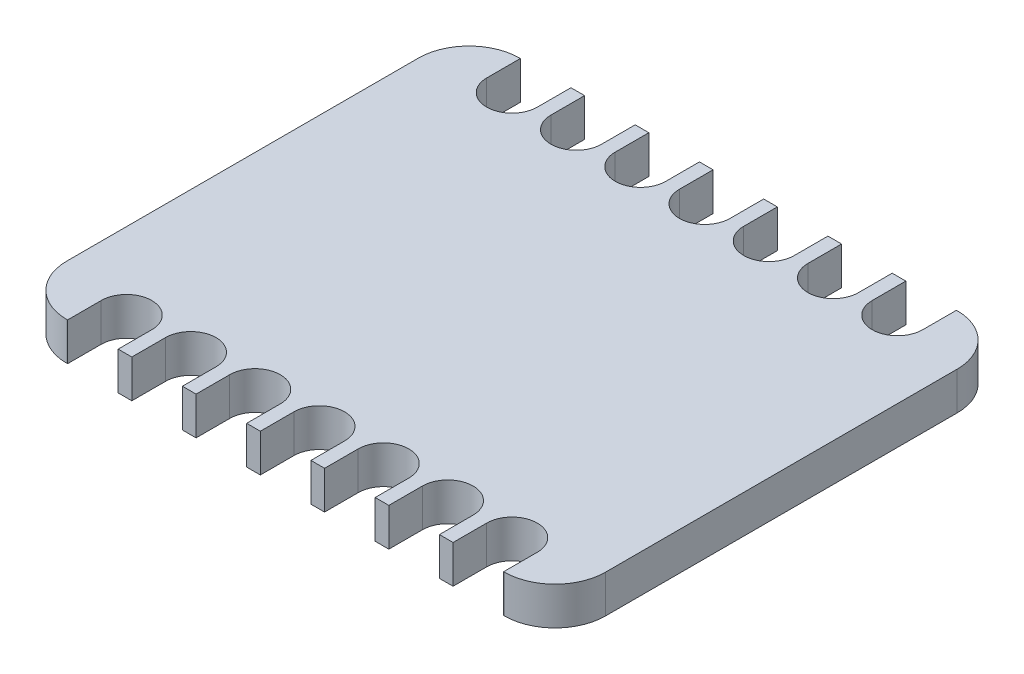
ISO-10303-21;
HEADER;
FILE_DESCRIPTION(('STEP AP214'),'2;1');
FILE_NAME('part.step','',(''),(''),'','','');
FILE_SCHEMA(('AUTOMOTIVE_DESIGN { 1 0 10303 214 1 1 1 1 }'));
ENDSEC;
DATA;
#1=APPLICATION_CONTEXT('core data for automotive mechanical design processes');
#2=APPLICATION_PROTOCOL_DEFINITION('international standard','automotive_design',2000,#1);
#3=PRODUCT_CONTEXT('',#1,'mechanical');
#4=PRODUCT('Part','Part','',(#3));
#5=PRODUCT_RELATED_PRODUCT_CATEGORY('part','',(#4));
#6=PRODUCT_DEFINITION_FORMATION('','',#4);
#7=PRODUCT_DEFINITION_CONTEXT('part definition',#1,'design');
#8=PRODUCT_DEFINITION('design','',#6,#7);
#9=PRODUCT_DEFINITION_SHAPE('','',#8);
#10=(LENGTH_UNIT() NAMED_UNIT(*) SI_UNIT(.MILLI.,.METRE.));
#11=(NAMED_UNIT(*) PLANE_ANGLE_UNIT() SI_UNIT($,.RADIAN.));
#12=(NAMED_UNIT(*) SI_UNIT($,.STERADIAN.) SOLID_ANGLE_UNIT());
#13=UNCERTAINTY_MEASURE_WITH_UNIT(LENGTH_MEASURE(1.E-05),#10,'distance_accuracy_value','');
#14=(GEOMETRIC_REPRESENTATION_CONTEXT(3) GLOBAL_UNCERTAINTY_ASSIGNED_CONTEXT((#13)) GLOBAL_UNIT_ASSIGNED_CONTEXT((#10,
#11,#12)) REPRESENTATION_CONTEXT('',''));
#15=CARTESIAN_POINT('',(0.,0.,0.));
#16=DIRECTION('',(0.,0.,1.));
#17=DIRECTION('',(1.,0.,0.));
#18=AXIS2_PLACEMENT_3D('',#15,#16,#17);
#19=CARTESIAN_POINT('',(-8.65,1.5,-6.95));
#20=DIRECTION('',(0.,-1.,0.));
#21=DIRECTION('',(0.,0.,-1.));
#22=AXIS2_PLACEMENT_3D('',#19,#20,#21);
#23=CYLINDRICAL_SURFACE('',#22,2.);
#24=CARTESIAN_POINT('',(-8.65,0.,-6.95));
#25=DIRECTION('',(0.,1.,0.));
#26=DIRECTION('',(0.,0.,1.));
#27=AXIS2_PLACEMENT_3D('',#24,#25,#26);
#28=CIRCLE('',#27,2.);
#29=CARTESIAN_POINT('',(-8.65,0.,-8.95));
#30=VERTEX_POINT('',#29);
#31=CARTESIAN_POINT('',(-10.65,0.,-6.95));
#32=VERTEX_POINT('',#31);
#33=EDGE_CURVE('E471',#30,#32,#28,.T.);
#34=ORIENTED_EDGE('',*,*,#33,.T.);
#35=DIRECTION('',(0.,-1.,0.));
#36=VECTOR('',#35,1.);
#37=CARTESIAN_POINT('',(-10.65,1.5,-6.95));
#38=LINE('',#37,#36);
#39=CARTESIAN_POINT('',(-10.65,1.5,-6.95));
#40=VERTEX_POINT('',#39);
#41=EDGE_CURVE('E11',#40,#32,#38,.T.);
#42=ORIENTED_EDGE('',*,*,#41,.F.);
#43=CARTESIAN_POINT('',(-8.65,1.5,-6.95));
#44=DIRECTION('',(0.,1.,0.));
#45=DIRECTION('',(0.,0.,1.));
#46=AXIS2_PLACEMENT_3D('',#43,#44,#45);
#47=CIRCLE('',#46,2.);
#48=CARTESIAN_POINT('',(-8.65,1.5,-8.95));
#49=VERTEX_POINT('',#48);
#50=EDGE_CURVE('E597',#49,#40,#47,.T.);
#51=ORIENTED_EDGE('',*,*,#50,.F.);
#52=DIRECTION('',(0.,-1.,0.));
#53=VECTOR('',#52,1.);
#54=CARTESIAN_POINT('',(-8.65,1.5,-8.95));
#55=LINE('',#54,#53);
#56=EDGE_CURVE('E467',#49,#30,#55,.T.);
#57=ORIENTED_EDGE('',*,*,#56,.T.);
#58=EDGE_LOOP('',(#34,#42,#51,#57));
#59=FACE_BOUND('',#58,.T.);
#60=ADVANCED_FACE('F39',(#59),#23,.T.);
#61=CARTESIAN_POINT('',(-10.65,1.5,-6.95));
#62=DIRECTION('',(1.,0.,0.));
#63=DIRECTION('',(0.,0.,-1.));
#64=AXIS2_PLACEMENT_3D('',#61,#62,#63);
#65=PLANE('',#64);
#66=DIRECTION('',(0.,0.,1.));
#67=VECTOR('',#66,1.);
#68=CARTESIAN_POINT('',(-10.65,0.,-6.95));
#69=LINE('',#68,#67);
#70=CARTESIAN_POINT('',(-10.65,0.,6.95));
#71=VERTEX_POINT('',#70);
#72=EDGE_CURVE('E474',#32,#71,#69,.T.);
#73=ORIENTED_EDGE('',*,*,#72,.T.);
#74=DIRECTION('',(0.,-1.,0.));
#75=VECTOR('',#74,1.);
#76=CARTESIAN_POINT('',(-10.65,1.5,6.95));
#77=LINE('',#76,#75);
#78=CARTESIAN_POINT('',(-10.65,1.5,6.95));
#79=VERTEX_POINT('',#78);
#80=EDGE_CURVE('E47',#79,#71,#77,.T.);
#81=ORIENTED_EDGE('',*,*,#80,.F.);
#82=DIRECTION('',(0.,0.,1.));
#83=VECTOR('',#82,1.);
#84=CARTESIAN_POINT('',(-10.65,1.5,-6.95));
#85=LINE('',#84,#83);
#86=EDGE_CURVE('E266',#40,#79,#85,.T.);
#87=ORIENTED_EDGE('',*,*,#86,.F.);
#88=ORIENTED_EDGE('',*,*,#41,.T.);
#89=EDGE_LOOP('',(#73,#81,#87,#88));
#90=FACE_BOUND('',#89,.T.);
#91=ADVANCED_FACE('F935',(#90),#65,.F.);
#92=CARTESIAN_POINT('',(-8.65,1.5,6.95));
#93=DIRECTION('',(0.,-1.,0.));
#94=DIRECTION('',(0.,0.,-1.));
#95=AXIS2_PLACEMENT_3D('',#92,#93,#94);
#96=CYLINDRICAL_SURFACE('',#95,2.);
#97=CARTESIAN_POINT('',(-8.65,0.,6.95));
#98=DIRECTION('',(0.,1.,0.));
#99=DIRECTION('',(0.,0.,1.));
#100=AXIS2_PLACEMENT_3D('',#97,#98,#99);
#101=CIRCLE('',#100,2.);
#102=CARTESIAN_POINT('',(-8.65,0.,8.95));
#103=VERTEX_POINT('',#102);
#104=EDGE_CURVE('E476',#71,#103,#101,.T.);
#105=ORIENTED_EDGE('',*,*,#104,.T.);
#106=DIRECTION('',(0.,-1.,0.));
#107=VECTOR('',#106,1.);
#108=CARTESIAN_POINT('',(-8.65,1.5,8.95));
#109=LINE('',#108,#107);
#110=CARTESIAN_POINT('',(-8.65,1.5,8.95));
#111=VERTEX_POINT('',#110);
#112=EDGE_CURVE('E772',#111,#103,#109,.T.);
#113=ORIENTED_EDGE('',*,*,#112,.F.);
#114=CARTESIAN_POINT('',(-8.65,1.5,6.95));
#115=DIRECTION('',(0.,1.,0.));
#116=DIRECTION('',(0.,0.,1.));
#117=AXIS2_PLACEMENT_3D('',#114,#115,#116);
#118=CIRCLE('',#117,2.);
#119=EDGE_CURVE('E780',#79,#111,#118,.T.);
#120=ORIENTED_EDGE('',*,*,#119,.F.);
#121=ORIENTED_EDGE('',*,*,#80,.T.);
#122=EDGE_LOOP('',(#105,#113,#120,#121));
#123=FACE_BOUND('',#122,.T.);
#124=ADVANCED_FACE('F778',(#123),#96,.T.);
#125=CARTESIAN_POINT('',(-8.65,1.5,8.95));
#126=DIRECTION('',(0.,0.,-1.));
#127=DIRECTION('',(-1.,0.,0.));
#128=AXIS2_PLACEMENT_3D('',#125,#126,#127);
#129=PLANE('',#128);
#130=DIRECTION('',(1.,0.,0.));
#131=VECTOR('',#130,1.);
#132=CARTESIAN_POINT('',(-8.65,0.,8.95));
#133=LINE('',#132,#131);
#134=CARTESIAN_POINT('',(-8.62,0.,8.95));
#135=VERTEX_POINT('',#134);
#136=EDGE_CURVE('E478',#103,#135,#133,.T.);
#137=ORIENTED_EDGE('',*,*,#136,.T.);
#138=DIRECTION('',(0.,-1.,0.));
#139=VECTOR('',#138,1.);
#140=CARTESIAN_POINT('',(-8.62,1.5,8.95));
#141=LINE('',#140,#139);
#142=CARTESIAN_POINT('',(-8.62,1.5,8.95));
#143=VERTEX_POINT('',#142);
#144=EDGE_CURVE('E769',#143,#135,#141,.T.);
#145=ORIENTED_EDGE('',*,*,#144,.F.);
#146=DIRECTION('',(1.,0.,0.));
#147=VECTOR('',#146,1.);
#148=CARTESIAN_POINT('',(-8.65,1.5,8.95));
#149=LINE('',#148,#147);
#150=EDGE_CURVE('E798',#111,#143,#149,.T.);
#151=ORIENTED_EDGE('',*,*,#150,.F.);
#152=ORIENTED_EDGE('',*,*,#112,.T.);
#153=EDGE_LOOP('',(#137,#145,#151,#152));
#154=FACE_BOUND('',#153,.T.);
#155=ADVANCED_FACE('F789',(#154),#129,.F.);
#156=CARTESIAN_POINT('',(-8.62,1.5,8.95));
#157=DIRECTION('',(-1.,0.,0.));
#158=DIRECTION('',(0.,0.,1.));
#159=AXIS2_PLACEMENT_3D('',#156,#157,#158);
#160=PLANE('',#159);
#161=DIRECTION('',(0.,0.,-1.));
#162=VECTOR('',#161,1.);
#163=CARTESIAN_POINT('',(-8.62,0.,8.95));
#164=LINE('',#163,#162);
#165=CARTESIAN_POINT('',(-8.62,0.,7.62));
#166=VERTEX_POINT('',#165);
#167=EDGE_CURVE('E480',#135,#166,#164,.T.);
#168=ORIENTED_EDGE('',*,*,#167,.T.);
#169=DIRECTION('',(0.,-1.,0.));
#170=VECTOR('',#169,1.);
#171=CARTESIAN_POINT('',(-8.62,1.5,7.62));
#172=LINE('',#171,#170);
#173=CARTESIAN_POINT('',(-8.62,1.5,7.62));
#174=VERTEX_POINT('',#173);
#175=EDGE_CURVE('E766',#174,#166,#172,.T.);
#176=ORIENTED_EDGE('',*,*,#175,.F.);
#177=DIRECTION('',(0.,0.,-1.));
#178=VECTOR('',#177,1.);
#179=CARTESIAN_POINT('',(-8.62,1.5,8.95));
#180=LINE('',#179,#178);
#181=EDGE_CURVE('E795',#143,#174,#180,.T.);
#182=ORIENTED_EDGE('',*,*,#181,.F.);
#183=ORIENTED_EDGE('',*,*,#144,.T.);
#184=EDGE_LOOP('',(#168,#176,#182,#183));
#185=FACE_BOUND('',#184,.T.);
#186=ADVANCED_FACE('F793',(#185),#160,.F.);
#187=CARTESIAN_POINT('',(-7.62,1.5,7.62));
#188=DIRECTION('',(0.,-1.,0.));
#189=DIRECTION('',(0.,0.,-1.));
#190=AXIS2_PLACEMENT_3D('',#187,#188,#189);
#191=CYLINDRICAL_SURFACE('',#190,1.);
#192=CARTESIAN_POINT('',(-7.62,0.,7.62));
#193=DIRECTION('',(0.,-1.,0.));
#194=DIRECTION('',(0.,0.,1.));
#195=AXIS2_PLACEMENT_3D('',#192,#193,#194);
#196=CIRCLE('',#195,1.);
#197=CARTESIAN_POINT('',(-6.62,0.,7.62));
#198=VERTEX_POINT('',#197);
#199=EDGE_CURVE('E482',#166,#198,#196,.T.);
#200=ORIENTED_EDGE('',*,*,#199,.T.);
#201=DIRECTION('',(0.,-1.,0.));
#202=VECTOR('',#201,1.);
#203=CARTESIAN_POINT('',(-6.62,1.5,7.62));
#204=LINE('',#203,#202);
#205=CARTESIAN_POINT('',(-6.62,1.5,7.62));
#206=VERTEX_POINT('',#205);
#207=EDGE_CURVE('E763',#206,#198,#204,.T.);
#208=ORIENTED_EDGE('',*,*,#207,.F.);
#209=CARTESIAN_POINT('',(-7.62,1.5,7.62));
#210=DIRECTION('',(0.,-1.,0.));
#211=DIRECTION('',(0.,0.,1.));
#212=AXIS2_PLACEMENT_3D('',#209,#210,#211);
#213=CIRCLE('',#212,1.);
#214=EDGE_CURVE('E797',#174,#206,#213,.T.);
#215=ORIENTED_EDGE('',*,*,#214,.F.);
#216=ORIENTED_EDGE('',*,*,#175,.T.);
#217=EDGE_LOOP('',(#200,#208,#215,#216));
#218=FACE_BOUND('',#217,.T.);
#219=ADVANCED_FACE('F948',(#218),#191,.F.);
#220=CARTESIAN_POINT('',(-6.62,1.5,7.62));
#221=DIRECTION('',(1.,0.,0.));
#222=DIRECTION('',(0.,0.,-1.));
#223=AXIS2_PLACEMENT_3D('',#220,#221,#222);
#224=PLANE('',#223);
#225=DIRECTION('',(0.,0.,1.));
#226=VECTOR('',#225,1.);
#227=CARTESIAN_POINT('',(-6.62,0.,7.62));
#228=LINE('',#227,#226);
#229=CARTESIAN_POINT('',(-6.62,0.,8.95));
#230=VERTEX_POINT('',#229);
#231=EDGE_CURVE('E484',#198,#230,#228,.T.);
#232=ORIENTED_EDGE('',*,*,#231,.T.);
#233=DIRECTION('',(0.,-1.,0.));
#234=VECTOR('',#233,1.);
#235=CARTESIAN_POINT('',(-6.62,1.5,8.95));
#236=LINE('',#235,#234);
#237=CARTESIAN_POINT('',(-6.62,1.5,8.95));
#238=VERTEX_POINT('',#237);
#239=EDGE_CURVE('E760',#238,#230,#236,.T.);
#240=ORIENTED_EDGE('',*,*,#239,.F.);
#241=DIRECTION('',(0.,0.,1.));
#242=VECTOR('',#241,1.);
#243=CARTESIAN_POINT('',(-6.62,1.5,7.62));
#244=LINE('',#243,#242);
#245=EDGE_CURVE('E800',#206,#238,#244,.T.);
#246=ORIENTED_EDGE('',*,*,#245,.F.);
#247=ORIENTED_EDGE('',*,*,#207,.T.);
#248=EDGE_LOOP('',(#232,#240,#246,#247));
#249=FACE_BOUND('',#248,.T.);
#250=ADVANCED_FACE('F951',(#249),#224,.F.);
#251=CARTESIAN_POINT('',(-6.62,1.5,8.95));
#252=DIRECTION('',(0.,0.,-1.));
#253=DIRECTION('',(-1.,0.,0.));
#254=AXIS2_PLACEMENT_3D('',#251,#252,#253);
#255=PLANE('',#254);
#256=DIRECTION('',(1.,0.,0.));
#257=VECTOR('',#256,1.);
#258=CARTESIAN_POINT('',(-6.62,0.,8.95));
#259=LINE('',#258,#257);
#260=CARTESIAN_POINT('',(-6.08,0.,8.95));
#261=VERTEX_POINT('',#260);
#262=EDGE_CURVE('E486',#230,#261,#259,.T.);
#263=ORIENTED_EDGE('',*,*,#262,.T.);
#264=DIRECTION('',(0.,-1.,0.));
#265=VECTOR('',#264,1.);
#266=CARTESIAN_POINT('',(-6.08,1.5,8.95));
#267=LINE('',#266,#265);
#268=CARTESIAN_POINT('',(-6.08,1.5,8.95));
#269=VERTEX_POINT('',#268);
#270=EDGE_CURVE('E757',#269,#261,#267,.T.);
#271=ORIENTED_EDGE('',*,*,#270,.F.);
#272=DIRECTION('',(1.,0.,0.));
#273=VECTOR('',#272,1.);
#274=CARTESIAN_POINT('',(-6.62,1.5,8.95));
#275=LINE('',#274,#273);
#276=EDGE_CURVE('E806',#238,#269,#275,.T.);
#277=ORIENTED_EDGE('',*,*,#276,.F.);
#278=ORIENTED_EDGE('',*,*,#239,.T.);
#279=EDGE_LOOP('',(#263,#271,#277,#278));
#280=FACE_BOUND('',#279,.T.);
#281=ADVANCED_FACE('F955',(#280),#255,.F.);
#282=CARTESIAN_POINT('',(-6.08,1.5,8.95));
#283=DIRECTION('',(-1.,0.,0.));
#284=DIRECTION('',(0.,0.,1.));
#285=AXIS2_PLACEMENT_3D('',#282,#283,#284);
#286=PLANE('',#285);
#287=DIRECTION('',(0.,0.,-1.));
#288=VECTOR('',#287,1.);
#289=CARTESIAN_POINT('',(-6.08,0.,8.95));
#290=LINE('',#289,#288);
#291=CARTESIAN_POINT('',(-6.08,0.,7.62));
#292=VERTEX_POINT('',#291);
#293=EDGE_CURVE('E488',#261,#292,#290,.T.);
#294=ORIENTED_EDGE('',*,*,#293,.T.);
#295=DIRECTION('',(0.,-1.,0.));
#296=VECTOR('',#295,1.);
#297=CARTESIAN_POINT('',(-6.08,1.5,7.62));
#298=LINE('',#297,#296);
#299=CARTESIAN_POINT('',(-6.08,1.5,7.62));
#300=VERTEX_POINT('',#299);
#301=EDGE_CURVE('E754',#300,#292,#298,.T.);
#302=ORIENTED_EDGE('',*,*,#301,.F.);
#303=DIRECTION('',(0.,0.,-1.));
#304=VECTOR('',#303,1.);
#305=CARTESIAN_POINT('',(-6.08,1.5,8.95));
#306=LINE('',#305,#304);
#307=EDGE_CURVE('E808',#269,#300,#306,.T.);
#308=ORIENTED_EDGE('',*,*,#307,.F.);
#309=ORIENTED_EDGE('',*,*,#270,.T.);
#310=EDGE_LOOP('',(#294,#302,#308,#309));
#311=FACE_BOUND('',#310,.T.);
#312=ADVANCED_FACE('F959',(#311),#286,.F.);
#313=CARTESIAN_POINT('',(-5.08,1.5,7.62));
#314=DIRECTION('',(0.,-1.,0.));
#315=DIRECTION('',(0.,0.,-1.));
#316=AXIS2_PLACEMENT_3D('',#313,#314,#315);
#317=CYLINDRICAL_SURFACE('',#316,1.);
#318=CARTESIAN_POINT('',(-5.08,0.,7.62));
#319=DIRECTION('',(0.,-1.,0.));
#320=DIRECTION('',(0.,0.,1.));
#321=AXIS2_PLACEMENT_3D('',#318,#319,#320);
#322=CIRCLE('',#321,1.);
#323=CARTESIAN_POINT('',(-4.08,0.,7.62));
#324=VERTEX_POINT('',#323);
#325=EDGE_CURVE('E490',#292,#324,#322,.T.);
#326=ORIENTED_EDGE('',*,*,#325,.T.);
#327=DIRECTION('',(0.,-1.,0.));
#328=VECTOR('',#327,1.);
#329=CARTESIAN_POINT('',(-4.08,1.5,7.62));
#330=LINE('',#329,#328);
#331=CARTESIAN_POINT('',(-4.08,1.5,7.62));
#332=VERTEX_POINT('',#331);
#333=EDGE_CURVE('E751',#332,#324,#330,.T.);
#334=ORIENTED_EDGE('',*,*,#333,.F.);
#335=CARTESIAN_POINT('',(-5.08,1.5,7.62));
#336=DIRECTION('',(0.,-1.,0.));
#337=DIRECTION('',(0.,0.,1.));
#338=AXIS2_PLACEMENT_3D('',#335,#336,#337);
#339=CIRCLE('',#338,1.);
#340=EDGE_CURVE('E810',#300,#332,#339,.T.);
#341=ORIENTED_EDGE('',*,*,#340,.F.);
#342=ORIENTED_EDGE('',*,*,#301,.T.);
#343=EDGE_LOOP('',(#326,#334,#341,#342));
#344=FACE_BOUND('',#343,.T.);
#345=ADVANCED_FACE('F963',(#344),#317,.F.);
#346=CARTESIAN_POINT('',(-4.08,1.5,7.62));
#347=DIRECTION('',(1.,0.,0.));
#348=DIRECTION('',(0.,0.,-1.));
#349=AXIS2_PLACEMENT_3D('',#346,#347,#348);
#350=PLANE('',#349);
#351=DIRECTION('',(0.,0.,1.));
#352=VECTOR('',#351,1.);
#353=CARTESIAN_POINT('',(-4.08,0.,7.62));
#354=LINE('',#353,#352);
#355=CARTESIAN_POINT('',(-4.08,0.,8.95));
#356=VERTEX_POINT('',#355);
#357=EDGE_CURVE('E492',#324,#356,#354,.T.);
#358=ORIENTED_EDGE('',*,*,#357,.T.);
#359=DIRECTION('',(0.,-1.,0.));
#360=VECTOR('',#359,1.);
#361=CARTESIAN_POINT('',(-4.08,1.5,8.95));
#362=LINE('',#361,#360);
#363=CARTESIAN_POINT('',(-4.08,1.5,8.95));
#364=VERTEX_POINT('',#363);
#365=EDGE_CURVE('E748',#364,#356,#362,.T.);
#366=ORIENTED_EDGE('',*,*,#365,.F.);
#367=DIRECTION('',(0.,0.,1.));
#368=VECTOR('',#367,1.);
#369=CARTESIAN_POINT('',(-4.08,1.5,7.62));
#370=LINE('',#369,#368);
#371=EDGE_CURVE('E812',#332,#364,#370,.T.);
#372=ORIENTED_EDGE('',*,*,#371,.F.);
#373=ORIENTED_EDGE('',*,*,#333,.T.);
#374=EDGE_LOOP('',(#358,#366,#372,#373));
#375=FACE_BOUND('',#374,.T.);
#376=ADVANCED_FACE('F967',(#375),#350,.F.);
#377=CARTESIAN_POINT('',(-4.08,1.5,8.95));
#378=DIRECTION('',(0.,0.,-1.));
#379=DIRECTION('',(-1.,0.,0.));
#380=AXIS2_PLACEMENT_3D('',#377,#378,#379);
#381=PLANE('',#380);
#382=DIRECTION('',(1.,0.,0.));
#383=VECTOR('',#382,1.);
#384=CARTESIAN_POINT('',(-4.08,0.,8.95));
#385=LINE('',#384,#383);
#386=CARTESIAN_POINT('',(-3.54,0.,8.95));
#387=VERTEX_POINT('',#386);
#388=EDGE_CURVE('E494',#356,#387,#385,.T.);
#389=ORIENTED_EDGE('',*,*,#388,.T.);
#390=DIRECTION('',(0.,-1.,0.));
#391=VECTOR('',#390,1.);
#392=CARTESIAN_POINT('',(-3.54,1.5,8.95));
#393=LINE('',#392,#391);
#394=CARTESIAN_POINT('',(-3.54,1.5,8.95));
#395=VERTEX_POINT('',#394);
#396=EDGE_CURVE('E745',#395,#387,#393,.T.);
#397=ORIENTED_EDGE('',*,*,#396,.F.);
#398=DIRECTION('',(1.,0.,0.));
#399=VECTOR('',#398,1.);
#400=CARTESIAN_POINT('',(-4.08,1.5,8.95));
#401=LINE('',#400,#399);
#402=EDGE_CURVE('E814',#364,#395,#401,.T.);
#403=ORIENTED_EDGE('',*,*,#402,.F.);
#404=ORIENTED_EDGE('',*,*,#365,.T.);
#405=EDGE_LOOP('',(#389,#397,#403,#404));
#406=FACE_BOUND('',#405,.T.);
#407=ADVANCED_FACE('F971',(#406),#381,.F.);
#408=CARTESIAN_POINT('',(-3.54,1.5,8.95));
#409=DIRECTION('',(-1.,0.,0.));
#410=DIRECTION('',(0.,0.,1.));
#411=AXIS2_PLACEMENT_3D('',#408,#409,#410);
#412=PLANE('',#411);
#413=DIRECTION('',(0.,0.,-1.));
#414=VECTOR('',#413,1.);
#415=CARTESIAN_POINT('',(-3.54,0.,8.95));
#416=LINE('',#415,#414);
#417=CARTESIAN_POINT('',(-3.54,0.,7.62));
#418=VERTEX_POINT('',#417);
#419=EDGE_CURVE('E496',#387,#418,#416,.T.);
#420=ORIENTED_EDGE('',*,*,#419,.T.);
#421=DIRECTION('',(0.,-1.,0.));
#422=VECTOR('',#421,1.);
#423=CARTESIAN_POINT('',(-3.54,1.5,7.62));
#424=LINE('',#423,#422);
#425=CARTESIAN_POINT('',(-3.54,1.5,7.62));
#426=VERTEX_POINT('',#425);
#427=EDGE_CURVE('E742',#426,#418,#424,.T.);
#428=ORIENTED_EDGE('',*,*,#427,.F.);
#429=DIRECTION('',(0.,0.,-1.));
#430=VECTOR('',#429,1.);
#431=CARTESIAN_POINT('',(-3.54,1.5,8.95));
#432=LINE('',#431,#430);
#433=EDGE_CURVE('E816',#395,#426,#432,.T.);
#434=ORIENTED_EDGE('',*,*,#433,.F.);
#435=ORIENTED_EDGE('',*,*,#396,.T.);
#436=EDGE_LOOP('',(#420,#428,#434,#435));
#437=FACE_BOUND('',#436,.T.);
#438=ADVANCED_FACE('F975',(#437),#412,.F.);
#439=CARTESIAN_POINT('',(-2.54,1.5,7.62));
#440=DIRECTION('',(0.,-1.,0.));
#441=DIRECTION('',(0.,0.,-1.));
#442=AXIS2_PLACEMENT_3D('',#439,#440,#441);
#443=CYLINDRICAL_SURFACE('',#442,1.);
#444=CARTESIAN_POINT('',(-2.54,0.,7.62));
#445=DIRECTION('',(0.,-1.,0.));
#446=DIRECTION('',(0.,0.,1.));
#447=AXIS2_PLACEMENT_3D('',#444,#445,#446);
#448=CIRCLE('',#447,1.);
#449=CARTESIAN_POINT('',(-1.54,0.,7.62));
#450=VERTEX_POINT('',#449);
#451=EDGE_CURVE('E498',#418,#450,#448,.T.);
#452=ORIENTED_EDGE('',*,*,#451,.T.);
#453=DIRECTION('',(0.,-1.,0.));
#454=VECTOR('',#453,1.);
#455=CARTESIAN_POINT('',(-1.54,1.5,7.62));
#456=LINE('',#455,#454);
#457=CARTESIAN_POINT('',(-1.54,1.5,7.62));
#458=VERTEX_POINT('',#457);
#459=EDGE_CURVE('E739',#458,#450,#456,.T.);
#460=ORIENTED_EDGE('',*,*,#459,.F.);
#461=CARTESIAN_POINT('',(-2.54,1.5,7.62));
#462=DIRECTION('',(0.,-1.,0.));
#463=DIRECTION('',(0.,0.,1.));
#464=AXIS2_PLACEMENT_3D('',#461,#462,#463);
#465=CIRCLE('',#464,1.);
#466=EDGE_CURVE('E818',#426,#458,#465,.T.);
#467=ORIENTED_EDGE('',*,*,#466,.F.);
#468=ORIENTED_EDGE('',*,*,#427,.T.);
#469=EDGE_LOOP('',(#452,#460,#467,#468));
#470=FACE_BOUND('',#469,.T.);
#471=ADVANCED_FACE('F979',(#470),#443,.F.);
#472=CARTESIAN_POINT('',(-1.54,1.5,7.62));
#473=DIRECTION('',(1.,0.,0.));
#474=DIRECTION('',(0.,0.,-1.));
#475=AXIS2_PLACEMENT_3D('',#472,#473,#474);
#476=PLANE('',#475);
#477=DIRECTION('',(0.,0.,1.));
#478=VECTOR('',#477,1.);
#479=CARTESIAN_POINT('',(-1.54,0.,7.62));
#480=LINE('',#479,#478);
#481=CARTESIAN_POINT('',(-1.54,0.,8.95));
#482=VERTEX_POINT('',#481);
#483=EDGE_CURVE('E500',#450,#482,#480,.T.);
#484=ORIENTED_EDGE('',*,*,#483,.T.);
#485=DIRECTION('',(0.,-1.,0.));
#486=VECTOR('',#485,1.);
#487=CARTESIAN_POINT('',(-1.54,1.5,8.95));
#488=LINE('',#487,#486);
#489=CARTESIAN_POINT('',(-1.54,1.5,8.95));
#490=VERTEX_POINT('',#489);
#491=EDGE_CURVE('E736',#490,#482,#488,.T.);
#492=ORIENTED_EDGE('',*,*,#491,.F.);
#493=DIRECTION('',(0.,0.,1.));
#494=VECTOR('',#493,1.);
#495=CARTESIAN_POINT('',(-1.54,1.5,7.62));
#496=LINE('',#495,#494);
#497=EDGE_CURVE('E820',#458,#490,#496,.T.);
#498=ORIENTED_EDGE('',*,*,#497,.F.);
#499=ORIENTED_EDGE('',*,*,#459,.T.);
#500=EDGE_LOOP('',(#484,#492,#498,#499));
#501=FACE_BOUND('',#500,.T.);
#502=ADVANCED_FACE('F983',(#501),#476,.F.);
#503=CARTESIAN_POINT('',(-1.54,1.5,8.95));
#504=DIRECTION('',(0.,0.,-1.));
#505=DIRECTION('',(-1.,0.,0.));
#506=AXIS2_PLACEMENT_3D('',#503,#504,#505);
#507=PLANE('',#506);
#508=DIRECTION('',(1.,0.,0.));
#509=VECTOR('',#508,1.);
#510=CARTESIAN_POINT('',(-1.54,0.,8.95));
#511=LINE('',#510,#509);
#512=CARTESIAN_POINT('',(-1.,0.,8.95));
#513=VERTEX_POINT('',#512);
#514=EDGE_CURVE('E502',#482,#513,#511,.T.);
#515=ORIENTED_EDGE('',*,*,#514,.T.);
#516=DIRECTION('',(0.,-1.,0.));
#517=VECTOR('',#516,1.);
#518=CARTESIAN_POINT('',(-1.,1.5,8.95));
#519=LINE('',#518,#517);
#520=CARTESIAN_POINT('',(-1.,1.5,8.95));
#521=VERTEX_POINT('',#520);
#522=EDGE_CURVE('E733',#521,#513,#519,.T.);
#523=ORIENTED_EDGE('',*,*,#522,.F.);
#524=DIRECTION('',(1.,0.,0.));
#525=VECTOR('',#524,1.);
#526=CARTESIAN_POINT('',(-1.54,1.5,8.95));
#527=LINE('',#526,#525);
#528=EDGE_CURVE('E822',#490,#521,#527,.T.);
#529=ORIENTED_EDGE('',*,*,#528,.F.);
#530=ORIENTED_EDGE('',*,*,#491,.T.);
#531=EDGE_LOOP('',(#515,#523,#529,#530));
#532=FACE_BOUND('',#531,.T.);
#533=ADVANCED_FACE('F987',(#532),#507,.F.);
#534=CARTESIAN_POINT('',(-1.,1.5,8.95));
#535=DIRECTION('',(-1.,0.,0.));
#536=DIRECTION('',(0.,0.,1.));
#537=AXIS2_PLACEMENT_3D('',#534,#535,#536);
#538=PLANE('',#537);
#539=DIRECTION('',(0.,0.,-1.));
#540=VECTOR('',#539,1.);
#541=CARTESIAN_POINT('',(-1.,0.,8.95));
#542=LINE('',#541,#540);
#543=CARTESIAN_POINT('',(-1.,0.,7.62));
#544=VERTEX_POINT('',#543);
#545=EDGE_CURVE('E504',#513,#544,#542,.T.);
#546=ORIENTED_EDGE('',*,*,#545,.T.);
#547=DIRECTION('',(0.,-1.,0.));
#548=VECTOR('',#547,1.);
#549=CARTESIAN_POINT('',(-1.,1.5,7.62));
#550=LINE('',#549,#548);
#551=CARTESIAN_POINT('',(-1.,1.5,7.62));
#552=VERTEX_POINT('',#551);
#553=EDGE_CURVE('E730',#552,#544,#550,.T.);
#554=ORIENTED_EDGE('',*,*,#553,.F.);
#555=DIRECTION('',(0.,0.,-1.));
#556=VECTOR('',#555,1.);
#557=CARTESIAN_POINT('',(-1.,1.5,8.95));
#558=LINE('',#557,#556);
#559=EDGE_CURVE('E824',#521,#552,#558,.T.);
#560=ORIENTED_EDGE('',*,*,#559,.F.);
#561=ORIENTED_EDGE('',*,*,#522,.T.);
#562=EDGE_LOOP('',(#546,#554,#560,#561));
#563=FACE_BOUND('',#562,.T.);
#564=ADVANCED_FACE('F991',(#563),#538,.F.);
#565=CARTESIAN_POINT('',(0.,1.5,7.62));
#566=DIRECTION('',(0.,-1.,0.));
#567=DIRECTION('',(0.,0.,-1.));
#568=AXIS2_PLACEMENT_3D('',#565,#566,#567);
#569=CYLINDRICAL_SURFACE('',#568,1.);
#570=CARTESIAN_POINT('',(0.,0.,7.62));
#571=DIRECTION('',(0.,-1.,0.));
#572=DIRECTION('',(0.,0.,1.));
#573=AXIS2_PLACEMENT_3D('',#570,#571,#572);
#574=CIRCLE('',#573,1.);
#575=CARTESIAN_POINT('',(1.,0.,7.62));
#576=VERTEX_POINT('',#575);
#577=EDGE_CURVE('E506',#544,#576,#574,.T.);
#578=ORIENTED_EDGE('',*,*,#577,.T.);
#579=DIRECTION('',(0.,-1.,0.));
#580=VECTOR('',#579,1.);
#581=CARTESIAN_POINT('',(1.,1.5,7.62));
#582=LINE('',#581,#580);
#583=CARTESIAN_POINT('',(1.,1.5,7.62));
#584=VERTEX_POINT('',#583);
#585=EDGE_CURVE('E727',#584,#576,#582,.T.);
#586=ORIENTED_EDGE('',*,*,#585,.F.);
#587=CARTESIAN_POINT('',(0.,1.5,7.62));
#588=DIRECTION('',(0.,-1.,0.));
#589=DIRECTION('',(0.,0.,1.));
#590=AXIS2_PLACEMENT_3D('',#587,#588,#589);
#591=CIRCLE('',#590,1.);
#592=EDGE_CURVE('E826',#552,#584,#591,.T.);
#593=ORIENTED_EDGE('',*,*,#592,.F.);
#594=ORIENTED_EDGE('',*,*,#553,.T.);
#595=EDGE_LOOP('',(#578,#586,#593,#594));
#596=FACE_BOUND('',#595,.T.);
#597=ADVANCED_FACE('F995',(#596),#569,.F.);
#598=CARTESIAN_POINT('',(1.,1.5,7.62));
#599=DIRECTION('',(1.,0.,0.));
#600=DIRECTION('',(0.,0.,-1.));
#601=AXIS2_PLACEMENT_3D('',#598,#599,#600);
#602=PLANE('',#601);
#603=DIRECTION('',(0.,0.,1.));
#604=VECTOR('',#603,1.);
#605=CARTESIAN_POINT('',(1.,0.,7.62));
#606=LINE('',#605,#604);
#607=CARTESIAN_POINT('',(1.,0.,8.95));
#608=VERTEX_POINT('',#607);
#609=EDGE_CURVE('E508',#576,#608,#606,.T.);
#610=ORIENTED_EDGE('',*,*,#609,.T.);
#611=DIRECTION('',(0.,-1.,0.));
#612=VECTOR('',#611,1.);
#613=CARTESIAN_POINT('',(1.,1.5,8.95));
#614=LINE('',#613,#612);
#615=CARTESIAN_POINT('',(1.,1.5,8.95));
#616=VERTEX_POINT('',#615);
#617=EDGE_CURVE('E724',#616,#608,#614,.T.);
#618=ORIENTED_EDGE('',*,*,#617,.F.);
#619=DIRECTION('',(0.,0.,1.));
#620=VECTOR('',#619,1.);
#621=CARTESIAN_POINT('',(1.,1.5,7.62));
#622=LINE('',#621,#620);
#623=EDGE_CURVE('E828',#584,#616,#622,.T.);
#624=ORIENTED_EDGE('',*,*,#623,.F.);
#625=ORIENTED_EDGE('',*,*,#585,.T.);
#626=EDGE_LOOP('',(#610,#618,#624,#625));
#627=FACE_BOUND('',#626,.T.);
#628=ADVANCED_FACE('F999',(#627),#602,.F.);
#629=CARTESIAN_POINT('',(1.,1.5,8.95));
#630=DIRECTION('',(0.,0.,-1.));
#631=DIRECTION('',(-1.,0.,0.));
#632=AXIS2_PLACEMENT_3D('',#629,#630,#631);
#633=PLANE('',#632);
#634=DIRECTION('',(1.,0.,0.));
#635=VECTOR('',#634,1.);
#636=CARTESIAN_POINT('',(1.,0.,8.95));
#637=LINE('',#636,#635);
#638=CARTESIAN_POINT('',(1.54,0.,8.95));
#639=VERTEX_POINT('',#638);
#640=EDGE_CURVE('E510',#608,#639,#637,.T.);
#641=ORIENTED_EDGE('',*,*,#640,.T.);
#642=DIRECTION('',(0.,-1.,0.));
#643=VECTOR('',#642,1.);
#644=CARTESIAN_POINT('',(1.54,1.5,8.95));
#645=LINE('',#644,#643);
#646=CARTESIAN_POINT('',(1.54,1.5,8.95));
#647=VERTEX_POINT('',#646);
#648=EDGE_CURVE('E721',#647,#639,#645,.T.);
#649=ORIENTED_EDGE('',*,*,#648,.F.);
#650=DIRECTION('',(1.,0.,0.));
#651=VECTOR('',#650,1.);
#652=CARTESIAN_POINT('',(1.,1.5,8.95));
#653=LINE('',#652,#651);
#654=EDGE_CURVE('E830',#616,#647,#653,.T.);
#655=ORIENTED_EDGE('',*,*,#654,.F.);
#656=ORIENTED_EDGE('',*,*,#617,.T.);
#657=EDGE_LOOP('',(#641,#649,#655,#656));
#658=FACE_BOUND('',#657,.T.);
#659=ADVANCED_FACE('F1003',(#658),#633,.F.);
#660=CARTESIAN_POINT('',(1.54,1.5,8.95));
#661=DIRECTION('',(-1.,0.,0.));
#662=DIRECTION('',(0.,0.,1.));
#663=AXIS2_PLACEMENT_3D('',#660,#661,#662);
#664=PLANE('',#663);
#665=DIRECTION('',(0.,0.,-1.));
#666=VECTOR('',#665,1.);
#667=CARTESIAN_POINT('',(1.54,0.,8.95));
#668=LINE('',#667,#666);
#669=CARTESIAN_POINT('',(1.54,0.,7.62));
#670=VERTEX_POINT('',#669);
#671=EDGE_CURVE('E512',#639,#670,#668,.T.);
#672=ORIENTED_EDGE('',*,*,#671,.T.);
#673=DIRECTION('',(0.,-1.,0.));
#674=VECTOR('',#673,1.);
#675=CARTESIAN_POINT('',(1.54,1.5,7.62));
#676=LINE('',#675,#674);
#677=CARTESIAN_POINT('',(1.54,1.5,7.62));
#678=VERTEX_POINT('',#677);
#679=EDGE_CURVE('E718',#678,#670,#676,.T.);
#680=ORIENTED_EDGE('',*,*,#679,.F.);
#681=DIRECTION('',(0.,0.,-1.));
#682=VECTOR('',#681,1.);
#683=CARTESIAN_POINT('',(1.54,1.5,8.95));
#684=LINE('',#683,#682);
#685=EDGE_CURVE('E832',#647,#678,#684,.T.);
#686=ORIENTED_EDGE('',*,*,#685,.F.);
#687=ORIENTED_EDGE('',*,*,#648,.T.);
#688=EDGE_LOOP('',(#672,#680,#686,#687));
#689=FACE_BOUND('',#688,.T.);
#690=ADVANCED_FACE('F1007',(#689),#664,.F.);
#691=CARTESIAN_POINT('',(2.54,1.5,7.62));
#692=DIRECTION('',(0.,-1.,0.));
#693=DIRECTION('',(0.,0.,-1.));
#694=AXIS2_PLACEMENT_3D('',#691,#692,#693);
#695=CYLINDRICAL_SURFACE('',#694,1.);
#696=CARTESIAN_POINT('',(2.54,0.,7.62));
#697=DIRECTION('',(0.,-1.,0.));
#698=DIRECTION('',(0.,0.,1.));
#699=AXIS2_PLACEMENT_3D('',#696,#697,#698);
#700=CIRCLE('',#699,1.);
#701=CARTESIAN_POINT('',(3.54,0.,7.62));
#702=VERTEX_POINT('',#701);
#703=EDGE_CURVE('E514',#670,#702,#700,.T.);
#704=ORIENTED_EDGE('',*,*,#703,.T.);
#705=DIRECTION('',(0.,-1.,0.));
#706=VECTOR('',#705,1.);
#707=CARTESIAN_POINT('',(3.54,1.5,7.62));
#708=LINE('',#707,#706);
#709=CARTESIAN_POINT('',(3.54,1.5,7.62));
#710=VERTEX_POINT('',#709);
#711=EDGE_CURVE('E715',#710,#702,#708,.T.);
#712=ORIENTED_EDGE('',*,*,#711,.F.);
#713=CARTESIAN_POINT('',(2.54,1.5,7.62));
#714=DIRECTION('',(0.,-1.,0.));
#715=DIRECTION('',(0.,0.,1.));
#716=AXIS2_PLACEMENT_3D('',#713,#714,#715);
#717=CIRCLE('',#716,1.);
#718=EDGE_CURVE('E834',#678,#710,#717,.T.);
#719=ORIENTED_EDGE('',*,*,#718,.F.);
#720=ORIENTED_EDGE('',*,*,#679,.T.);
#721=EDGE_LOOP('',(#704,#712,#719,#720));
#722=FACE_BOUND('',#721,.T.);
#723=ADVANCED_FACE('F1011',(#722),#695,.F.);
#724=CARTESIAN_POINT('',(3.54,1.5,7.62));
#725=DIRECTION('',(1.,0.,0.));
#726=DIRECTION('',(0.,0.,-1.));
#727=AXIS2_PLACEMENT_3D('',#724,#725,#726);
#728=PLANE('',#727);
#729=DIRECTION('',(0.,0.,1.));
#730=VECTOR('',#729,1.);
#731=CARTESIAN_POINT('',(3.54,0.,7.62));
#732=LINE('',#731,#730);
#733=CARTESIAN_POINT('',(3.54,0.,8.95));
#734=VERTEX_POINT('',#733);
#735=EDGE_CURVE('E516',#702,#734,#732,.T.);
#736=ORIENTED_EDGE('',*,*,#735,.T.);
#737=DIRECTION('',(0.,-1.,0.));
#738=VECTOR('',#737,1.);
#739=CARTESIAN_POINT('',(3.54,1.5,8.95));
#740=LINE('',#739,#738);
#741=CARTESIAN_POINT('',(3.54,1.5,8.95));
#742=VERTEX_POINT('',#741);
#743=EDGE_CURVE('E712',#742,#734,#740,.T.);
#744=ORIENTED_EDGE('',*,*,#743,.F.);
#745=DIRECTION('',(0.,0.,1.));
#746=VECTOR('',#745,1.);
#747=CARTESIAN_POINT('',(3.54,1.5,7.62));
#748=LINE('',#747,#746);
#749=EDGE_CURVE('E836',#710,#742,#748,.T.);
#750=ORIENTED_EDGE('',*,*,#749,.F.);
#751=ORIENTED_EDGE('',*,*,#711,.T.);
#752=EDGE_LOOP('',(#736,#744,#750,#751));
#753=FACE_BOUND('',#752,.T.);
#754=ADVANCED_FACE('F1015',(#753),#728,.F.);
#755=CARTESIAN_POINT('',(3.54,1.5,8.95));
#756=DIRECTION('',(0.,0.,-1.));
#757=DIRECTION('',(-1.,0.,0.));
#758=AXIS2_PLACEMENT_3D('',#755,#756,#757);
#759=PLANE('',#758);
#760=DIRECTION('',(1.,0.,0.));
#761=VECTOR('',#760,1.);
#762=CARTESIAN_POINT('',(3.54,0.,8.95));
#763=LINE('',#762,#761);
#764=CARTESIAN_POINT('',(4.08,0.,8.95));
#765=VERTEX_POINT('',#764);
#766=EDGE_CURVE('E518',#734,#765,#763,.T.);
#767=ORIENTED_EDGE('',*,*,#766,.T.);
#768=DIRECTION('',(0.,-1.,0.));
#769=VECTOR('',#768,1.);
#770=CARTESIAN_POINT('',(4.08,1.5,8.95));
#771=LINE('',#770,#769);
#772=CARTESIAN_POINT('',(4.08,1.5,8.95));
#773=VERTEX_POINT('',#772);
#774=EDGE_CURVE('E709',#773,#765,#771,.T.);
#775=ORIENTED_EDGE('',*,*,#774,.F.);
#776=DIRECTION('',(1.,0.,0.));
#777=VECTOR('',#776,1.);
#778=CARTESIAN_POINT('',(3.54,1.5,8.95));
#779=LINE('',#778,#777);
#780=EDGE_CURVE('E838',#742,#773,#779,.T.);
#781=ORIENTED_EDGE('',*,*,#780,.F.);
#782=ORIENTED_EDGE('',*,*,#743,.T.);
#783=EDGE_LOOP('',(#767,#775,#781,#782));
#784=FACE_BOUND('',#783,.T.);
#785=ADVANCED_FACE('F1019',(#784),#759,.F.);
#786=CARTESIAN_POINT('',(4.08,1.5,8.95));
#787=DIRECTION('',(-1.,0.,0.));
#788=DIRECTION('',(0.,0.,1.));
#789=AXIS2_PLACEMENT_3D('',#786,#787,#788);
#790=PLANE('',#789);
#791=DIRECTION('',(0.,0.,-1.));
#792=VECTOR('',#791,1.);
#793=CARTESIAN_POINT('',(4.08,0.,8.95));
#794=LINE('',#793,#792);
#795=CARTESIAN_POINT('',(4.08,0.,7.62));
#796=VERTEX_POINT('',#795);
#797=EDGE_CURVE('E520',#765,#796,#794,.T.);
#798=ORIENTED_EDGE('',*,*,#797,.T.);
#799=DIRECTION('',(0.,-1.,0.));
#800=VECTOR('',#799,1.);
#801=CARTESIAN_POINT('',(4.08,1.5,7.62));
#802=LINE('',#801,#800);
#803=CARTESIAN_POINT('',(4.08,1.5,7.62));
#804=VERTEX_POINT('',#803);
#805=EDGE_CURVE('E706',#804,#796,#802,.T.);
#806=ORIENTED_EDGE('',*,*,#805,.F.);
#807=DIRECTION('',(0.,0.,-1.));
#808=VECTOR('',#807,1.);
#809=CARTESIAN_POINT('',(4.08,1.5,8.95));
#810=LINE('',#809,#808);
#811=EDGE_CURVE('E840',#773,#804,#810,.T.);
#812=ORIENTED_EDGE('',*,*,#811,.F.);
#813=ORIENTED_EDGE('',*,*,#774,.T.);
#814=EDGE_LOOP('',(#798,#806,#812,#813));
#815=FACE_BOUND('',#814,.T.);
#816=ADVANCED_FACE('F1023',(#815),#790,.F.);
#817=CARTESIAN_POINT('',(5.08,1.5,7.62));
#818=DIRECTION('',(0.,-1.,0.));
#819=DIRECTION('',(0.,0.,-1.));
#820=AXIS2_PLACEMENT_3D('',#817,#818,#819);
#821=CYLINDRICAL_SURFACE('',#820,1.);
#822=CARTESIAN_POINT('',(5.08,0.,7.62));
#823=DIRECTION('',(0.,-1.,0.));
#824=DIRECTION('',(0.,0.,1.));
#825=AXIS2_PLACEMENT_3D('',#822,#823,#824);
#826=CIRCLE('',#825,1.);
#827=CARTESIAN_POINT('',(6.08,0.,7.62));
#828=VERTEX_POINT('',#827);
#829=EDGE_CURVE('E522',#796,#828,#826,.T.);
#830=ORIENTED_EDGE('',*,*,#829,.T.);
#831=DIRECTION('',(0.,-1.,0.));
#832=VECTOR('',#831,1.);
#833=CARTESIAN_POINT('',(6.08,1.5,7.62));
#834=LINE('',#833,#832);
#835=CARTESIAN_POINT('',(6.08,1.5,7.62));
#836=VERTEX_POINT('',#835);
#837=EDGE_CURVE('E703',#836,#828,#834,.T.);
#838=ORIENTED_EDGE('',*,*,#837,.F.);
#839=CARTESIAN_POINT('',(5.08,1.5,7.62));
#840=DIRECTION('',(0.,-1.,0.));
#841=DIRECTION('',(0.,0.,1.));
#842=AXIS2_PLACEMENT_3D('',#839,#840,#841);
#843=CIRCLE('',#842,1.);
#844=EDGE_CURVE('E842',#804,#836,#843,.T.);
#845=ORIENTED_EDGE('',*,*,#844,.F.);
#846=ORIENTED_EDGE('',*,*,#805,.T.);
#847=EDGE_LOOP('',(#830,#838,#845,#846));
#848=FACE_BOUND('',#847,.T.);
#849=ADVANCED_FACE('F1027',(#848),#821,.F.);
#850=CARTESIAN_POINT('',(6.08,1.5,7.62));
#851=DIRECTION('',(1.,0.,0.));
#852=DIRECTION('',(0.,0.,-1.));
#853=AXIS2_PLACEMENT_3D('',#850,#851,#852);
#854=PLANE('',#853);
#855=DIRECTION('',(0.,0.,1.));
#856=VECTOR('',#855,1.);
#857=CARTESIAN_POINT('',(6.08,0.,7.62));
#858=LINE('',#857,#856);
#859=CARTESIAN_POINT('',(6.08,0.,8.95));
#860=VERTEX_POINT('',#859);
#861=EDGE_CURVE('E524',#828,#860,#858,.T.);
#862=ORIENTED_EDGE('',*,*,#861,.T.);
#863=DIRECTION('',(0.,-1.,0.));
#864=VECTOR('',#863,1.);
#865=CARTESIAN_POINT('',(6.08,1.5,8.95));
#866=LINE('',#865,#864);
#867=CARTESIAN_POINT('',(6.08,1.5,8.95));
#868=VERTEX_POINT('',#867);
#869=EDGE_CURVE('E700',#868,#860,#866,.T.);
#870=ORIENTED_EDGE('',*,*,#869,.F.);
#871=DIRECTION('',(0.,0.,1.));
#872=VECTOR('',#871,1.);
#873=CARTESIAN_POINT('',(6.08,1.5,7.62));
#874=LINE('',#873,#872);
#875=EDGE_CURVE('E844',#836,#868,#874,.T.);
#876=ORIENTED_EDGE('',*,*,#875,.F.);
#877=ORIENTED_EDGE('',*,*,#837,.T.);
#878=EDGE_LOOP('',(#862,#870,#876,#877));
#879=FACE_BOUND('',#878,.T.);
#880=ADVANCED_FACE('F1031',(#879),#854,.F.);
#881=CARTESIAN_POINT('',(6.08,1.5,8.95));
#882=DIRECTION('',(0.,0.,-1.));
#883=DIRECTION('',(-1.,0.,0.));
#884=AXIS2_PLACEMENT_3D('',#881,#882,#883);
#885=PLANE('',#884);
#886=DIRECTION('',(1.,0.,0.));
#887=VECTOR('',#886,1.);
#888=CARTESIAN_POINT('',(6.08,0.,8.95));
#889=LINE('',#888,#887);
#890=CARTESIAN_POINT('',(6.62,0.,8.95));
#891=VERTEX_POINT('',#890);
#892=EDGE_CURVE('E526',#860,#891,#889,.T.);
#893=ORIENTED_EDGE('',*,*,#892,.T.);
#894=DIRECTION('',(0.,-1.,0.));
#895=VECTOR('',#894,1.);
#896=CARTESIAN_POINT('',(6.62,1.5,8.95));
#897=LINE('',#896,#895);
#898=CARTESIAN_POINT('',(6.62,1.5,8.95));
#899=VERTEX_POINT('',#898);
#900=EDGE_CURVE('E697',#899,#891,#897,.T.);
#901=ORIENTED_EDGE('',*,*,#900,.F.);
#902=DIRECTION('',(1.,0.,0.));
#903=VECTOR('',#902,1.);
#904=CARTESIAN_POINT('',(6.08,1.5,8.95));
#905=LINE('',#904,#903);
#906=EDGE_CURVE('E846',#868,#899,#905,.T.);
#907=ORIENTED_EDGE('',*,*,#906,.F.);
#908=ORIENTED_EDGE('',*,*,#869,.T.);
#909=EDGE_LOOP('',(#893,#901,#907,#908));
#910=FACE_BOUND('',#909,.T.);
#911=ADVANCED_FACE('F1035',(#910),#885,.F.);
#912=CARTESIAN_POINT('',(6.62,1.5,8.95));
#913=DIRECTION('',(-1.,0.,0.));
#914=DIRECTION('',(0.,0.,1.));
#915=AXIS2_PLACEMENT_3D('',#912,#913,#914);
#916=PLANE('',#915);
#917=DIRECTION('',(0.,0.,-1.));
#918=VECTOR('',#917,1.);
#919=CARTESIAN_POINT('',(6.62,0.,8.95));
#920=LINE('',#919,#918);
#921=CARTESIAN_POINT('',(6.62,0.,7.62));
#922=VERTEX_POINT('',#921);
#923=EDGE_CURVE('E528',#891,#922,#920,.T.);
#924=ORIENTED_EDGE('',*,*,#923,.T.);
#925=DIRECTION('',(0.,-1.,0.));
#926=VECTOR('',#925,1.);
#927=CARTESIAN_POINT('',(6.62,1.5,7.62));
#928=LINE('',#927,#926);
#929=CARTESIAN_POINT('',(6.62,1.5,7.62));
#930=VERTEX_POINT('',#929);
#931=EDGE_CURVE('E694',#930,#922,#928,.T.);
#932=ORIENTED_EDGE('',*,*,#931,.F.);
#933=DIRECTION('',(0.,0.,-1.));
#934=VECTOR('',#933,1.);
#935=CARTESIAN_POINT('',(6.62,1.5,8.95));
#936=LINE('',#935,#934);
#937=EDGE_CURVE('E848',#899,#930,#936,.T.);
#938=ORIENTED_EDGE('',*,*,#937,.F.);
#939=ORIENTED_EDGE('',*,*,#900,.T.);
#940=EDGE_LOOP('',(#924,#932,#938,#939));
#941=FACE_BOUND('',#940,.T.);
#942=ADVANCED_FACE('F1039',(#941),#916,.F.);
#943=CARTESIAN_POINT('',(7.62,1.5,7.62));
#944=DIRECTION('',(0.,-1.,0.));
#945=DIRECTION('',(0.,0.,-1.));
#946=AXIS2_PLACEMENT_3D('',#943,#944,#945);
#947=CYLINDRICAL_SURFACE('',#946,1.);
#948=CARTESIAN_POINT('',(7.62,0.,7.62));
#949=DIRECTION('',(0.,-1.,0.));
#950=DIRECTION('',(0.,0.,1.));
#951=AXIS2_PLACEMENT_3D('',#948,#949,#950);
#952=CIRCLE('',#951,1.);
#953=CARTESIAN_POINT('',(8.62,0.,7.62));
#954=VERTEX_POINT('',#953);
#955=EDGE_CURVE('E530',#922,#954,#952,.T.);
#956=ORIENTED_EDGE('',*,*,#955,.T.);
#957=DIRECTION('',(0.,-1.,0.));
#958=VECTOR('',#957,1.);
#959=CARTESIAN_POINT('',(8.62,1.5,7.62));
#960=LINE('',#959,#958);
#961=CARTESIAN_POINT('',(8.62,1.5,7.62));
#962=VERTEX_POINT('',#961);
#963=EDGE_CURVE('E691',#962,#954,#960,.T.);
#964=ORIENTED_EDGE('',*,*,#963,.F.);
#965=CARTESIAN_POINT('',(7.62,1.5,7.62));
#966=DIRECTION('',(0.,-1.,0.));
#967=DIRECTION('',(0.,0.,1.));
#968=AXIS2_PLACEMENT_3D('',#965,#966,#967);
#969=CIRCLE('',#968,1.);
#970=EDGE_CURVE('E850',#930,#962,#969,.T.);
#971=ORIENTED_EDGE('',*,*,#970,.F.);
#972=ORIENTED_EDGE('',*,*,#931,.T.);
#973=EDGE_LOOP('',(#956,#964,#971,#972));
#974=FACE_BOUND('',#973,.T.);
#975=ADVANCED_FACE('F1043',(#974),#947,.F.);
#976=CARTESIAN_POINT('',(8.62,1.5,7.62));
#977=DIRECTION('',(1.,0.,0.));
#978=DIRECTION('',(0.,0.,-1.));
#979=AXIS2_PLACEMENT_3D('',#976,#977,#978);
#980=PLANE('',#979);
#981=DIRECTION('',(0.,0.,1.));
#982=VECTOR('',#981,1.);
#983=CARTESIAN_POINT('',(8.62,0.,7.62));
#984=LINE('',#983,#982);
#985=CARTESIAN_POINT('',(8.62,0.,8.95));
#986=VERTEX_POINT('',#985);
#987=EDGE_CURVE('E532',#954,#986,#984,.T.);
#988=ORIENTED_EDGE('',*,*,#987,.T.);
#989=DIRECTION('',(0.,-1.,0.));
#990=VECTOR('',#989,1.);
#991=CARTESIAN_POINT('',(8.62,1.5,8.95));
#992=LINE('',#991,#990);
#993=CARTESIAN_POINT('',(8.62,1.5,8.95));
#994=VERTEX_POINT('',#993);
#995=EDGE_CURVE('E688',#994,#986,#992,.T.);
#996=ORIENTED_EDGE('',*,*,#995,.F.);
#997=DIRECTION('',(0.,0.,1.));
#998=VECTOR('',#997,1.);
#999=CARTESIAN_POINT('',(8.62,1.5,7.62));
#1000=LINE('',#999,#998);
#1001=EDGE_CURVE('E852',#962,#994,#1000,.T.);
#1002=ORIENTED_EDGE('',*,*,#1001,.F.);
#1003=ORIENTED_EDGE('',*,*,#963,.T.);
#1004=EDGE_LOOP('',(#988,#996,#1002,#1003));
#1005=FACE_BOUND('',#1004,.T.);
#1006=ADVANCED_FACE('F1047',(#1005),#980,.F.);
#1007=CARTESIAN_POINT('',(8.62,1.5,8.95));
#1008=DIRECTION('',(0.,0.,-1.));
#1009=DIRECTION('',(-1.,0.,0.));
#1010=AXIS2_PLACEMENT_3D('',#1007,#1008,#1009);
#1011=PLANE('',#1010);
#1012=DIRECTION('',(1.,0.,0.));
#1013=VECTOR('',#1012,1.);
#1014=CARTESIAN_POINT('',(8.62,0.,8.95));
#1015=LINE('',#1014,#1013);
#1016=CARTESIAN_POINT('',(8.65,0.,8.95));
#1017=VERTEX_POINT('',#1016);
#1018=EDGE_CURVE('E534',#986,#1017,#1015,.T.);
#1019=ORIENTED_EDGE('',*,*,#1018,.T.);
#1020=DIRECTION('',(0.,-1.,0.));
#1021=VECTOR('',#1020,1.);
#1022=CARTESIAN_POINT('',(8.65,1.5,8.95));
#1023=LINE('',#1022,#1021);
#1024=CARTESIAN_POINT('',(8.65,1.5,8.95));
#1025=VERTEX_POINT('',#1024);
#1026=EDGE_CURVE('E685',#1025,#1017,#1023,.T.);
#1027=ORIENTED_EDGE('',*,*,#1026,.F.);
#1028=DIRECTION('',(1.,0.,0.));
#1029=VECTOR('',#1028,1.);
#1030=CARTESIAN_POINT('',(8.62,1.5,8.95));
#1031=LINE('',#1030,#1029);
#1032=EDGE_CURVE('E854',#994,#1025,#1031,.T.);
#1033=ORIENTED_EDGE('',*,*,#1032,.F.);
#1034=ORIENTED_EDGE('',*,*,#995,.T.);
#1035=EDGE_LOOP('',(#1019,#1027,#1033,#1034));
#1036=FACE_BOUND('',#1035,.T.);
#1037=ADVANCED_FACE('F1051',(#1036),#1011,.F.);
#1038=CARTESIAN_POINT('',(8.65,1.5,6.95));
#1039=DIRECTION('',(0.,-1.,0.));
#1040=DIRECTION('',(0.,0.,-1.));
#1041=AXIS2_PLACEMENT_3D('',#1038,#1039,#1040);
#1042=CYLINDRICAL_SURFACE('',#1041,2.);
#1043=CARTESIAN_POINT('',(8.65,0.,6.95));
#1044=DIRECTION('',(0.,1.,0.));
#1045=DIRECTION('',(0.,0.,1.));
#1046=AXIS2_PLACEMENT_3D('',#1043,#1044,#1045);
#1047=CIRCLE('',#1046,2.);
#1048=CARTESIAN_POINT('',(10.65,0.,6.95));
#1049=VERTEX_POINT('',#1048);
#1050=EDGE_CURVE('E536',#1017,#1049,#1047,.T.);
#1051=ORIENTED_EDGE('',*,*,#1050,.T.);
#1052=DIRECTION('',(0.,-1.,0.));
#1053=VECTOR('',#1052,1.);
#1054=CARTESIAN_POINT('',(10.65,1.5,6.95));
#1055=LINE('',#1054,#1053);
#1056=CARTESIAN_POINT('',(10.65,1.5,6.95));
#1057=VERTEX_POINT('',#1056);
#1058=EDGE_CURVE('E682',#1057,#1049,#1055,.T.);
#1059=ORIENTED_EDGE('',*,*,#1058,.F.);
#1060=CARTESIAN_POINT('',(8.65,1.5,6.95));
#1061=DIRECTION('',(0.,1.,0.));
#1062=DIRECTION('',(0.,0.,1.));
#1063=AXIS2_PLACEMENT_3D('',#1060,#1061,#1062);
#1064=CIRCLE('',#1063,2.);
#1065=EDGE_CURVE('E856',#1025,#1057,#1064,.T.);
#1066=ORIENTED_EDGE('',*,*,#1065,.F.);
#1067=ORIENTED_EDGE('',*,*,#1026,.T.);
#1068=EDGE_LOOP('',(#1051,#1059,#1066,#1067));
#1069=FACE_BOUND('',#1068,.T.);
#1070=ADVANCED_FACE('F1055',(#1069),#1042,.T.);
#1071=CARTESIAN_POINT('',(10.65,1.5,6.95));
#1072=DIRECTION('',(-1.,0.,0.));
#1073=DIRECTION('',(0.,0.,1.));
#1074=AXIS2_PLACEMENT_3D('',#1071,#1072,#1073);
#1075=PLANE('',#1074);
#1076=DIRECTION('',(0.,0.,-1.));
#1077=VECTOR('',#1076,1.);
#1078=CARTESIAN_POINT('',(10.65,0.,6.95));
#1079=LINE('',#1078,#1077);
#1080=CARTESIAN_POINT('',(10.65,0.,-6.95));
#1081=VERTEX_POINT('',#1080);
#1082=EDGE_CURVE('E538',#1049,#1081,#1079,.T.);
#1083=ORIENTED_EDGE('',*,*,#1082,.T.);
#1084=DIRECTION('',(0.,-1.,0.));
#1085=VECTOR('',#1084,1.);
#1086=CARTESIAN_POINT('',(10.65,1.5,-6.95));
#1087=LINE('',#1086,#1085);
#1088=CARTESIAN_POINT('',(10.65,1.5,-6.95));
#1089=VERTEX_POINT('',#1088);
#1090=EDGE_CURVE('E679',#1089,#1081,#1087,.T.);
#1091=ORIENTED_EDGE('',*,*,#1090,.F.);
#1092=DIRECTION('',(0.,0.,-1.));
#1093=VECTOR('',#1092,1.);
#1094=CARTESIAN_POINT('',(10.65,1.5,6.95));
#1095=LINE('',#1094,#1093);
#1096=EDGE_CURVE('E858',#1057,#1089,#1095,.T.);
#1097=ORIENTED_EDGE('',*,*,#1096,.F.);
#1098=ORIENTED_EDGE('',*,*,#1058,.T.);
#1099=EDGE_LOOP('',(#1083,#1091,#1097,#1098));
#1100=FACE_BOUND('',#1099,.T.);
#1101=ADVANCED_FACE('F1059',(#1100),#1075,.F.);
#1102=CARTESIAN_POINT('',(8.65,1.5,-6.95));
#1103=DIRECTION('',(0.,-1.,0.));
#1104=DIRECTION('',(0.,0.,-1.));
#1105=AXIS2_PLACEMENT_3D('',#1102,#1103,#1104);
#1106=CYLINDRICAL_SURFACE('',#1105,2.);
#1107=CARTESIAN_POINT('',(8.65,0.,-6.95));
#1108=DIRECTION('',(0.,1.,0.));
#1109=DIRECTION('',(0.,0.,1.));
#1110=AXIS2_PLACEMENT_3D('',#1107,#1108,#1109);
#1111=CIRCLE('',#1110,2.);
#1112=CARTESIAN_POINT('',(8.65,0.,-8.95));
#1113=VERTEX_POINT('',#1112);
#1114=EDGE_CURVE('E540',#1081,#1113,#1111,.T.);
#1115=ORIENTED_EDGE('',*,*,#1114,.T.);
#1116=DIRECTION('',(0.,-1.,0.));
#1117=VECTOR('',#1116,1.);
#1118=CARTESIAN_POINT('',(8.65,1.5,-8.95));
#1119=LINE('',#1118,#1117);
#1120=CARTESIAN_POINT('',(8.65,1.5,-8.95));
#1121=VERTEX_POINT('',#1120);
#1122=EDGE_CURVE('E676',#1121,#1113,#1119,.T.);
#1123=ORIENTED_EDGE('',*,*,#1122,.F.);
#1124=CARTESIAN_POINT('',(8.65,1.5,-6.95));
#1125=DIRECTION('',(0.,1.,0.));
#1126=DIRECTION('',(0.,0.,1.));
#1127=AXIS2_PLACEMENT_3D('',#1124,#1125,#1126);
#1128=CIRCLE('',#1127,2.);
#1129=EDGE_CURVE('E860',#1089,#1121,#1128,.T.);
#1130=ORIENTED_EDGE('',*,*,#1129,.F.);
#1131=ORIENTED_EDGE('',*,*,#1090,.T.);
#1132=EDGE_LOOP('',(#1115,#1123,#1130,#1131));
#1133=FACE_BOUND('',#1132,.T.);
#1134=ADVANCED_FACE('F1063',(#1133),#1106,.T.);
#1135=CARTESIAN_POINT('',(8.65,1.5,-8.95));
#1136=DIRECTION('',(0.,0.,1.));
#1137=DIRECTION('',(1.,0.,0.));
#1138=AXIS2_PLACEMENT_3D('',#1135,#1136,#1137);
#1139=PLANE('',#1138);
#1140=DIRECTION('',(-1.,0.,0.));
#1141=VECTOR('',#1140,1.);
#1142=CARTESIAN_POINT('',(8.65,0.,-8.95));
#1143=LINE('',#1142,#1141);
#1144=CARTESIAN_POINT('',(8.62,0.,-8.95));
#1145=VERTEX_POINT('',#1144);
#1146=EDGE_CURVE('E542',#1113,#1145,#1143,.T.);
#1147=ORIENTED_EDGE('',*,*,#1146,.T.);
#1148=DIRECTION('',(0.,-1.,0.));
#1149=VECTOR('',#1148,1.);
#1150=CARTESIAN_POINT('',(8.62,1.5,-8.95));
#1151=LINE('',#1150,#1149);
#1152=CARTESIAN_POINT('',(8.62,1.5,-8.95));
#1153=VERTEX_POINT('',#1152);
#1154=EDGE_CURVE('E673',#1153,#1145,#1151,.T.);
#1155=ORIENTED_EDGE('',*,*,#1154,.F.);
#1156=DIRECTION('',(-1.,0.,0.));
#1157=VECTOR('',#1156,1.);
#1158=CARTESIAN_POINT('',(8.65,1.5,-8.95));
#1159=LINE('',#1158,#1157);
#1160=EDGE_CURVE('E862',#1121,#1153,#1159,.T.);
#1161=ORIENTED_EDGE('',*,*,#1160,.F.);
#1162=ORIENTED_EDGE('',*,*,#1122,.T.);
#1163=EDGE_LOOP('',(#1147,#1155,#1161,#1162));
#1164=FACE_BOUND('',#1163,.T.);
#1165=ADVANCED_FACE('F1067',(#1164),#1139,.F.);
#1166=CARTESIAN_POINT('',(8.62,1.5,-8.95));
#1167=DIRECTION('',(1.,0.,0.));
#1168=DIRECTION('',(0.,0.,-1.));
#1169=AXIS2_PLACEMENT_3D('',#1166,#1167,#1168);
#1170=PLANE('',#1169);
#1171=DIRECTION('',(0.,0.,1.));
#1172=VECTOR('',#1171,1.);
#1173=CARTESIAN_POINT('',(8.62,0.,-8.95));
#1174=LINE('',#1173,#1172);
#1175=CARTESIAN_POINT('',(8.62,0.,-7.62));
#1176=VERTEX_POINT('',#1175);
#1177=EDGE_CURVE('E544',#1145,#1176,#1174,.T.);
#1178=ORIENTED_EDGE('',*,*,#1177,.T.);
#1179=DIRECTION('',(0.,-1.,0.));
#1180=VECTOR('',#1179,1.);
#1181=CARTESIAN_POINT('',(8.62,1.5,-7.62));
#1182=LINE('',#1181,#1180);
#1183=CARTESIAN_POINT('',(8.62,1.5,-7.62));
#1184=VERTEX_POINT('',#1183);
#1185=EDGE_CURVE('E670',#1184,#1176,#1182,.T.);
#1186=ORIENTED_EDGE('',*,*,#1185,.F.);
#1187=DIRECTION('',(0.,0.,1.));
#1188=VECTOR('',#1187,1.);
#1189=CARTESIAN_POINT('',(8.62,1.5,-8.95));
#1190=LINE('',#1189,#1188);
#1191=EDGE_CURVE('E864',#1153,#1184,#1190,.T.);
#1192=ORIENTED_EDGE('',*,*,#1191,.F.);
#1193=ORIENTED_EDGE('',*,*,#1154,.T.);
#1194=EDGE_LOOP('',(#1178,#1186,#1192,#1193));
#1195=FACE_BOUND('',#1194,.T.);
#1196=ADVANCED_FACE('F1071',(#1195),#1170,.F.);
#1197=CARTESIAN_POINT('',(7.62,1.5,-7.62));
#1198=DIRECTION('',(0.,-1.,0.));
#1199=DIRECTION('',(0.,0.,-1.));
#1200=AXIS2_PLACEMENT_3D('',#1197,#1198,#1199);
#1201=CYLINDRICAL_SURFACE('',#1200,1.);
#1202=CARTESIAN_POINT('',(7.62,0.,-7.62));
#1203=DIRECTION('',(0.,-1.,0.));
#1204=DIRECTION('',(0.,0.,1.));
#1205=AXIS2_PLACEMENT_3D('',#1202,#1203,#1204);
#1206=CIRCLE('',#1205,1.);
#1207=CARTESIAN_POINT('',(6.62,0.,-7.62));
#1208=VERTEX_POINT('',#1207);
#1209=EDGE_CURVE('E546',#1176,#1208,#1206,.T.);
#1210=ORIENTED_EDGE('',*,*,#1209,.T.);
#1211=DIRECTION('',(0.,-1.,0.));
#1212=VECTOR('',#1211,1.);
#1213=CARTESIAN_POINT('',(6.62,1.5,-7.62));
#1214=LINE('',#1213,#1212);
#1215=CARTESIAN_POINT('',(6.62,1.5,-7.62));
#1216=VERTEX_POINT('',#1215);
#1217=EDGE_CURVE('E667',#1216,#1208,#1214,.T.);
#1218=ORIENTED_EDGE('',*,*,#1217,.F.);
#1219=CARTESIAN_POINT('',(7.62,1.5,-7.62));
#1220=DIRECTION('',(0.,-1.,0.));
#1221=DIRECTION('',(0.,0.,1.));
#1222=AXIS2_PLACEMENT_3D('',#1219,#1220,#1221);
#1223=CIRCLE('',#1222,1.);
#1224=EDGE_CURVE('E866',#1184,#1216,#1223,.T.);
#1225=ORIENTED_EDGE('',*,*,#1224,.F.);
#1226=ORIENTED_EDGE('',*,*,#1185,.T.);
#1227=EDGE_LOOP('',(#1210,#1218,#1225,#1226));
#1228=FACE_BOUND('',#1227,.T.);
#1229=ADVANCED_FACE('F1075',(#1228),#1201,.F.);
#1230=CARTESIAN_POINT('',(6.62,1.5,-7.62));
#1231=DIRECTION('',(-1.,0.,0.));
#1232=DIRECTION('',(0.,0.,1.));
#1233=AXIS2_PLACEMENT_3D('',#1230,#1231,#1232);
#1234=PLANE('',#1233);
#1235=DIRECTION('',(0.,0.,-1.));
#1236=VECTOR('',#1235,1.);
#1237=CARTESIAN_POINT('',(6.62,0.,-7.62));
#1238=LINE('',#1237,#1236);
#1239=CARTESIAN_POINT('',(6.62,0.,-8.95));
#1240=VERTEX_POINT('',#1239);
#1241=EDGE_CURVE('E548',#1208,#1240,#1238,.T.);
#1242=ORIENTED_EDGE('',*,*,#1241,.T.);
#1243=DIRECTION('',(0.,-1.,0.));
#1244=VECTOR('',#1243,1.);
#1245=CARTESIAN_POINT('',(6.62,1.5,-8.95));
#1246=LINE('',#1245,#1244);
#1247=CARTESIAN_POINT('',(6.62,1.5,-8.95));
#1248=VERTEX_POINT('',#1247);
#1249=EDGE_CURVE('E664',#1248,#1240,#1246,.T.);
#1250=ORIENTED_EDGE('',*,*,#1249,.F.);
#1251=DIRECTION('',(0.,0.,-1.));
#1252=VECTOR('',#1251,1.);
#1253=CARTESIAN_POINT('',(6.62,1.5,-7.62));
#1254=LINE('',#1253,#1252);
#1255=EDGE_CURVE('E868',#1216,#1248,#1254,.T.);
#1256=ORIENTED_EDGE('',*,*,#1255,.F.);
#1257=ORIENTED_EDGE('',*,*,#1217,.T.);
#1258=EDGE_LOOP('',(#1242,#1250,#1256,#1257));
#1259=FACE_BOUND('',#1258,.T.);
#1260=ADVANCED_FACE('F1079',(#1259),#1234,.F.);
#1261=CARTESIAN_POINT('',(6.62,1.5,-8.95));
#1262=DIRECTION('',(0.,0.,1.));
#1263=DIRECTION('',(1.,0.,0.));
#1264=AXIS2_PLACEMENT_3D('',#1261,#1262,#1263);
#1265=PLANE('',#1264);
#1266=DIRECTION('',(-1.,0.,0.));
#1267=VECTOR('',#1266,1.);
#1268=CARTESIAN_POINT('',(6.62,0.,-8.95));
#1269=LINE('',#1268,#1267);
#1270=CARTESIAN_POINT('',(6.08,0.,-8.95));
#1271=VERTEX_POINT('',#1270);
#1272=EDGE_CURVE('E550',#1240,#1271,#1269,.T.);
#1273=ORIENTED_EDGE('',*,*,#1272,.T.);
#1274=DIRECTION('',(0.,-1.,0.));
#1275=VECTOR('',#1274,1.);
#1276=CARTESIAN_POINT('',(6.08,1.5,-8.95));
#1277=LINE('',#1276,#1275);
#1278=CARTESIAN_POINT('',(6.08,1.5,-8.95));
#1279=VERTEX_POINT('',#1278);
#1280=EDGE_CURVE('E661',#1279,#1271,#1277,.T.);
#1281=ORIENTED_EDGE('',*,*,#1280,.F.);
#1282=DIRECTION('',(-1.,0.,0.));
#1283=VECTOR('',#1282,1.);
#1284=CARTESIAN_POINT('',(6.62,1.5,-8.95));
#1285=LINE('',#1284,#1283);
#1286=EDGE_CURVE('E870',#1248,#1279,#1285,.T.);
#1287=ORIENTED_EDGE('',*,*,#1286,.F.);
#1288=ORIENTED_EDGE('',*,*,#1249,.T.);
#1289=EDGE_LOOP('',(#1273,#1281,#1287,#1288));
#1290=FACE_BOUND('',#1289,.T.);
#1291=ADVANCED_FACE('F1083',(#1290),#1265,.F.);
#1292=CARTESIAN_POINT('',(6.08,1.5,-8.95));
#1293=DIRECTION('',(1.,0.,0.));
#1294=DIRECTION('',(0.,0.,-1.));
#1295=AXIS2_PLACEMENT_3D('',#1292,#1293,#1294);
#1296=PLANE('',#1295);
#1297=DIRECTION('',(0.,0.,1.));
#1298=VECTOR('',#1297,1.);
#1299=CARTESIAN_POINT('',(6.08,0.,-8.95));
#1300=LINE('',#1299,#1298);
#1301=CARTESIAN_POINT('',(6.08,0.,-7.62));
#1302=VERTEX_POINT('',#1301);
#1303=EDGE_CURVE('E552',#1271,#1302,#1300,.T.);
#1304=ORIENTED_EDGE('',*,*,#1303,.T.);
#1305=DIRECTION('',(0.,-1.,0.));
#1306=VECTOR('',#1305,1.);
#1307=CARTESIAN_POINT('',(6.08,1.5,-7.62));
#1308=LINE('',#1307,#1306);
#1309=CARTESIAN_POINT('',(6.08,1.5,-7.62));
#1310=VERTEX_POINT('',#1309);
#1311=EDGE_CURVE('E658',#1310,#1302,#1308,.T.);
#1312=ORIENTED_EDGE('',*,*,#1311,.F.);
#1313=DIRECTION('',(0.,0.,1.));
#1314=VECTOR('',#1313,1.);
#1315=CARTESIAN_POINT('',(6.08,1.5,-8.95));
#1316=LINE('',#1315,#1314);
#1317=EDGE_CURVE('E872',#1279,#1310,#1316,.T.);
#1318=ORIENTED_EDGE('',*,*,#1317,.F.);
#1319=ORIENTED_EDGE('',*,*,#1280,.T.);
#1320=EDGE_LOOP('',(#1304,#1312,#1318,#1319));
#1321=FACE_BOUND('',#1320,.T.);
#1322=ADVANCED_FACE('F1087',(#1321),#1296,.F.);
#1323=CARTESIAN_POINT('',(5.08,1.5,-7.62));
#1324=DIRECTION('',(0.,-1.,0.));
#1325=DIRECTION('',(0.,0.,-1.));
#1326=AXIS2_PLACEMENT_3D('',#1323,#1324,#1325);
#1327=CYLINDRICAL_SURFACE('',#1326,1.);
#1328=CARTESIAN_POINT('',(5.08,0.,-7.62));
#1329=DIRECTION('',(0.,-1.,0.));
#1330=DIRECTION('',(0.,0.,1.));
#1331=AXIS2_PLACEMENT_3D('',#1328,#1329,#1330);
#1332=CIRCLE('',#1331,1.);
#1333=CARTESIAN_POINT('',(4.08,0.,-7.62));
#1334=VERTEX_POINT('',#1333);
#1335=EDGE_CURVE('E554',#1302,#1334,#1332,.T.);
#1336=ORIENTED_EDGE('',*,*,#1335,.T.);
#1337=DIRECTION('',(0.,-1.,0.));
#1338=VECTOR('',#1337,1.);
#1339=CARTESIAN_POINT('',(4.08,1.5,-7.62));
#1340=LINE('',#1339,#1338);
#1341=CARTESIAN_POINT('',(4.08,1.5,-7.62));
#1342=VERTEX_POINT('',#1341);
#1343=EDGE_CURVE('E655',#1342,#1334,#1340,.T.);
#1344=ORIENTED_EDGE('',*,*,#1343,.F.);
#1345=CARTESIAN_POINT('',(5.08,1.5,-7.62));
#1346=DIRECTION('',(0.,-1.,0.));
#1347=DIRECTION('',(0.,0.,1.));
#1348=AXIS2_PLACEMENT_3D('',#1345,#1346,#1347);
#1349=CIRCLE('',#1348,1.);
#1350=EDGE_CURVE('E874',#1310,#1342,#1349,.T.);
#1351=ORIENTED_EDGE('',*,*,#1350,.F.);
#1352=ORIENTED_EDGE('',*,*,#1311,.T.);
#1353=EDGE_LOOP('',(#1336,#1344,#1351,#1352));
#1354=FACE_BOUND('',#1353,.T.);
#1355=ADVANCED_FACE('F1091',(#1354),#1327,.F.);
#1356=CARTESIAN_POINT('',(4.08,1.5,-7.62));
#1357=DIRECTION('',(-1.,0.,0.));
#1358=DIRECTION('',(0.,0.,1.));
#1359=AXIS2_PLACEMENT_3D('',#1356,#1357,#1358);
#1360=PLANE('',#1359);
#1361=DIRECTION('',(0.,0.,-1.));
#1362=VECTOR('',#1361,1.);
#1363=CARTESIAN_POINT('',(4.08,0.,-7.62));
#1364=LINE('',#1363,#1362);
#1365=CARTESIAN_POINT('',(4.08,0.,-8.95));
#1366=VERTEX_POINT('',#1365);
#1367=EDGE_CURVE('E556',#1334,#1366,#1364,.T.);
#1368=ORIENTED_EDGE('',*,*,#1367,.T.);
#1369=DIRECTION('',(0.,-1.,0.));
#1370=VECTOR('',#1369,1.);
#1371=CARTESIAN_POINT('',(4.08,1.5,-8.95));
#1372=LINE('',#1371,#1370);
#1373=CARTESIAN_POINT('',(4.08,1.5,-8.95));
#1374=VERTEX_POINT('',#1373);
#1375=EDGE_CURVE('E652',#1374,#1366,#1372,.T.);
#1376=ORIENTED_EDGE('',*,*,#1375,.F.);
#1377=DIRECTION('',(0.,0.,-1.));
#1378=VECTOR('',#1377,1.);
#1379=CARTESIAN_POINT('',(4.08,1.5,-7.62));
#1380=LINE('',#1379,#1378);
#1381=EDGE_CURVE('E876',#1342,#1374,#1380,.T.);
#1382=ORIENTED_EDGE('',*,*,#1381,.F.);
#1383=ORIENTED_EDGE('',*,*,#1343,.T.);
#1384=EDGE_LOOP('',(#1368,#1376,#1382,#1383));
#1385=FACE_BOUND('',#1384,.T.);
#1386=ADVANCED_FACE('F1095',(#1385),#1360,.F.);
#1387=CARTESIAN_POINT('',(4.08,1.5,-8.95));
#1388=DIRECTION('',(0.,0.,1.));
#1389=DIRECTION('',(1.,0.,0.));
#1390=AXIS2_PLACEMENT_3D('',#1387,#1388,#1389);
#1391=PLANE('',#1390);
#1392=DIRECTION('',(-1.,0.,0.));
#1393=VECTOR('',#1392,1.);
#1394=CARTESIAN_POINT('',(4.08,0.,-8.95));
#1395=LINE('',#1394,#1393);
#1396=CARTESIAN_POINT('',(3.54,0.,-8.95));
#1397=VERTEX_POINT('',#1396);
#1398=EDGE_CURVE('E558',#1366,#1397,#1395,.T.);
#1399=ORIENTED_EDGE('',*,*,#1398,.T.);
#1400=DIRECTION('',(0.,-1.,0.));
#1401=VECTOR('',#1400,1.);
#1402=CARTESIAN_POINT('',(3.54,1.5,-8.95));
#1403=LINE('',#1402,#1401);
#1404=CARTESIAN_POINT('',(3.54,1.5,-8.95));
#1405=VERTEX_POINT('',#1404);
#1406=EDGE_CURVE('E649',#1405,#1397,#1403,.T.);
#1407=ORIENTED_EDGE('',*,*,#1406,.F.);
#1408=DIRECTION('',(-1.,0.,0.));
#1409=VECTOR('',#1408,1.);
#1410=CARTESIAN_POINT('',(4.08,1.5,-8.95));
#1411=LINE('',#1410,#1409);
#1412=EDGE_CURVE('E878',#1374,#1405,#1411,.T.);
#1413=ORIENTED_EDGE('',*,*,#1412,.F.);
#1414=ORIENTED_EDGE('',*,*,#1375,.T.);
#1415=EDGE_LOOP('',(#1399,#1407,#1413,#1414));
#1416=FACE_BOUND('',#1415,.T.);
#1417=ADVANCED_FACE('F1099',(#1416),#1391,.F.);
#1418=CARTESIAN_POINT('',(3.54,1.5,-8.95));
#1419=DIRECTION('',(1.,0.,0.));
#1420=DIRECTION('',(0.,0.,-1.));
#1421=AXIS2_PLACEMENT_3D('',#1418,#1419,#1420);
#1422=PLANE('',#1421);
#1423=DIRECTION('',(0.,0.,1.));
#1424=VECTOR('',#1423,1.);
#1425=CARTESIAN_POINT('',(3.54,0.,-8.95));
#1426=LINE('',#1425,#1424);
#1427=CARTESIAN_POINT('',(3.54,0.,-7.62));
#1428=VERTEX_POINT('',#1427);
#1429=EDGE_CURVE('E560',#1397,#1428,#1426,.T.);
#1430=ORIENTED_EDGE('',*,*,#1429,.T.);
#1431=DIRECTION('',(0.,-1.,0.));
#1432=VECTOR('',#1431,1.);
#1433=CARTESIAN_POINT('',(3.54,1.5,-7.62));
#1434=LINE('',#1433,#1432);
#1435=CARTESIAN_POINT('',(3.54,1.5,-7.62));
#1436=VERTEX_POINT('',#1435);
#1437=EDGE_CURVE('E646',#1436,#1428,#1434,.T.);
#1438=ORIENTED_EDGE('',*,*,#1437,.F.);
#1439=DIRECTION('',(0.,0.,1.));
#1440=VECTOR('',#1439,1.);
#1441=CARTESIAN_POINT('',(3.54,1.5,-8.95));
#1442=LINE('',#1441,#1440);
#1443=EDGE_CURVE('E880',#1405,#1436,#1442,.T.);
#1444=ORIENTED_EDGE('',*,*,#1443,.F.);
#1445=ORIENTED_EDGE('',*,*,#1406,.T.);
#1446=EDGE_LOOP('',(#1430,#1438,#1444,#1445));
#1447=FACE_BOUND('',#1446,.T.);
#1448=ADVANCED_FACE('F1103',(#1447),#1422,.F.);
#1449=CARTESIAN_POINT('',(2.54,1.5,-7.62));
#1450=DIRECTION('',(0.,-1.,0.));
#1451=DIRECTION('',(0.,0.,-1.));
#1452=AXIS2_PLACEMENT_3D('',#1449,#1450,#1451);
#1453=CYLINDRICAL_SURFACE('',#1452,1.);
#1454=CARTESIAN_POINT('',(2.54,0.,-7.62));
#1455=DIRECTION('',(0.,-1.,0.));
#1456=DIRECTION('',(0.,0.,1.));
#1457=AXIS2_PLACEMENT_3D('',#1454,#1455,#1456);
#1458=CIRCLE('',#1457,1.);
#1459=CARTESIAN_POINT('',(1.54,0.,-7.62));
#1460=VERTEX_POINT('',#1459);
#1461=EDGE_CURVE('E562',#1428,#1460,#1458,.T.);
#1462=ORIENTED_EDGE('',*,*,#1461,.T.);
#1463=DIRECTION('',(0.,-1.,0.));
#1464=VECTOR('',#1463,1.);
#1465=CARTESIAN_POINT('',(1.54,1.5,-7.62));
#1466=LINE('',#1465,#1464);
#1467=CARTESIAN_POINT('',(1.54,1.5,-7.62));
#1468=VERTEX_POINT('',#1467);
#1469=EDGE_CURVE('E643',#1468,#1460,#1466,.T.);
#1470=ORIENTED_EDGE('',*,*,#1469,.F.);
#1471=CARTESIAN_POINT('',(2.54,1.5,-7.62));
#1472=DIRECTION('',(0.,-1.,0.));
#1473=DIRECTION('',(0.,0.,1.));
#1474=AXIS2_PLACEMENT_3D('',#1471,#1472,#1473);
#1475=CIRCLE('',#1474,1.);
#1476=EDGE_CURVE('E882',#1436,#1468,#1475,.T.);
#1477=ORIENTED_EDGE('',*,*,#1476,.F.);
#1478=ORIENTED_EDGE('',*,*,#1437,.T.);
#1479=EDGE_LOOP('',(#1462,#1470,#1477,#1478));
#1480=FACE_BOUND('',#1479,.T.);
#1481=ADVANCED_FACE('F1107',(#1480),#1453,.F.);
#1482=CARTESIAN_POINT('',(1.54,1.5,-7.62));
#1483=DIRECTION('',(-1.,0.,0.));
#1484=DIRECTION('',(0.,0.,1.));
#1485=AXIS2_PLACEMENT_3D('',#1482,#1483,#1484);
#1486=PLANE('',#1485);
#1487=DIRECTION('',(0.,0.,-1.));
#1488=VECTOR('',#1487,1.);
#1489=CARTESIAN_POINT('',(1.54,0.,-7.62));
#1490=LINE('',#1489,#1488);
#1491=CARTESIAN_POINT('',(1.54,0.,-8.95));
#1492=VERTEX_POINT('',#1491);
#1493=EDGE_CURVE('E564',#1460,#1492,#1490,.T.);
#1494=ORIENTED_EDGE('',*,*,#1493,.T.);
#1495=DIRECTION('',(0.,-1.,0.));
#1496=VECTOR('',#1495,1.);
#1497=CARTESIAN_POINT('',(1.54,1.5,-8.95));
#1498=LINE('',#1497,#1496);
#1499=CARTESIAN_POINT('',(1.54,1.5,-8.95));
#1500=VERTEX_POINT('',#1499);
#1501=EDGE_CURVE('E640',#1500,#1492,#1498,.T.);
#1502=ORIENTED_EDGE('',*,*,#1501,.F.);
#1503=DIRECTION('',(0.,0.,-1.));
#1504=VECTOR('',#1503,1.);
#1505=CARTESIAN_POINT('',(1.54,1.5,-7.62));
#1506=LINE('',#1505,#1504);
#1507=EDGE_CURVE('E884',#1468,#1500,#1506,.T.);
#1508=ORIENTED_EDGE('',*,*,#1507,.F.);
#1509=ORIENTED_EDGE('',*,*,#1469,.T.);
#1510=EDGE_LOOP('',(#1494,#1502,#1508,#1509));
#1511=FACE_BOUND('',#1510,.T.);
#1512=ADVANCED_FACE('F1111',(#1511),#1486,.F.);
#1513=CARTESIAN_POINT('',(1.54,1.5,-8.95));
#1514=DIRECTION('',(0.,0.,1.));
#1515=DIRECTION('',(1.,0.,0.));
#1516=AXIS2_PLACEMENT_3D('',#1513,#1514,#1515);
#1517=PLANE('',#1516);
#1518=DIRECTION('',(-1.,0.,0.));
#1519=VECTOR('',#1518,1.);
#1520=CARTESIAN_POINT('',(1.54,0.,-8.95));
#1521=LINE('',#1520,#1519);
#1522=CARTESIAN_POINT('',(1.,0.,-8.95));
#1523=VERTEX_POINT('',#1522);
#1524=EDGE_CURVE('E566',#1492,#1523,#1521,.T.);
#1525=ORIENTED_EDGE('',*,*,#1524,.T.);
#1526=DIRECTION('',(0.,-1.,0.));
#1527=VECTOR('',#1526,1.);
#1528=CARTESIAN_POINT('',(1.,1.5,-8.95));
#1529=LINE('',#1528,#1527);
#1530=CARTESIAN_POINT('',(1.,1.5,-8.95));
#1531=VERTEX_POINT('',#1530);
#1532=EDGE_CURVE('E637',#1531,#1523,#1529,.T.);
#1533=ORIENTED_EDGE('',*,*,#1532,.F.);
#1534=DIRECTION('',(-1.,0.,0.));
#1535=VECTOR('',#1534,1.);
#1536=CARTESIAN_POINT('',(1.54,1.5,-8.95));
#1537=LINE('',#1536,#1535);
#1538=EDGE_CURVE('E886',#1500,#1531,#1537,.T.);
#1539=ORIENTED_EDGE('',*,*,#1538,.F.);
#1540=ORIENTED_EDGE('',*,*,#1501,.T.);
#1541=EDGE_LOOP('',(#1525,#1533,#1539,#1540));
#1542=FACE_BOUND('',#1541,.T.);
#1543=ADVANCED_FACE('F1115',(#1542),#1517,.F.);
#1544=CARTESIAN_POINT('',(1.,1.5,-8.95));
#1545=DIRECTION('',(1.,0.,0.));
#1546=DIRECTION('',(0.,0.,-1.));
#1547=AXIS2_PLACEMENT_3D('',#1544,#1545,#1546);
#1548=PLANE('',#1547);
#1549=DIRECTION('',(0.,0.,1.));
#1550=VECTOR('',#1549,1.);
#1551=CARTESIAN_POINT('',(1.,0.,-8.95));
#1552=LINE('',#1551,#1550);
#1553=CARTESIAN_POINT('',(1.,0.,-7.62));
#1554=VERTEX_POINT('',#1553);
#1555=EDGE_CURVE('E568',#1523,#1554,#1552,.T.);
#1556=ORIENTED_EDGE('',*,*,#1555,.T.);
#1557=DIRECTION('',(0.,-1.,0.));
#1558=VECTOR('',#1557,1.);
#1559=CARTESIAN_POINT('',(1.,1.5,-7.62));
#1560=LINE('',#1559,#1558);
#1561=CARTESIAN_POINT('',(1.,1.5,-7.62));
#1562=VERTEX_POINT('',#1561);
#1563=EDGE_CURVE('E634',#1562,#1554,#1560,.T.);
#1564=ORIENTED_EDGE('',*,*,#1563,.F.);
#1565=DIRECTION('',(0.,0.,1.));
#1566=VECTOR('',#1565,1.);
#1567=CARTESIAN_POINT('',(1.,1.5,-8.95));
#1568=LINE('',#1567,#1566);
#1569=EDGE_CURVE('E888',#1531,#1562,#1568,.T.);
#1570=ORIENTED_EDGE('',*,*,#1569,.F.);
#1571=ORIENTED_EDGE('',*,*,#1532,.T.);
#1572=EDGE_LOOP('',(#1556,#1564,#1570,#1571));
#1573=FACE_BOUND('',#1572,.T.);
#1574=ADVANCED_FACE('F1119',(#1573),#1548,.F.);
#1575=CARTESIAN_POINT('',(0.,1.5,-7.62));
#1576=DIRECTION('',(0.,-1.,0.));
#1577=DIRECTION('',(0.,0.,-1.));
#1578=AXIS2_PLACEMENT_3D('',#1575,#1576,#1577);
#1579=CYLINDRICAL_SURFACE('',#1578,1.);
#1580=CARTESIAN_POINT('',(0.,0.,-7.62));
#1581=DIRECTION('',(0.,-1.,0.));
#1582=DIRECTION('',(0.,0.,1.));
#1583=AXIS2_PLACEMENT_3D('',#1580,#1581,#1582);
#1584=CIRCLE('',#1583,1.);
#1585=CARTESIAN_POINT('',(-1.,0.,-7.62));
#1586=VERTEX_POINT('',#1585);
#1587=EDGE_CURVE('E570',#1554,#1586,#1584,.T.);
#1588=ORIENTED_EDGE('',*,*,#1587,.T.);
#1589=DIRECTION('',(0.,-1.,0.));
#1590=VECTOR('',#1589,1.);
#1591=CARTESIAN_POINT('',(-1.,1.5,-7.62));
#1592=LINE('',#1591,#1590);
#1593=CARTESIAN_POINT('',(-1.,1.5,-7.62));
#1594=VERTEX_POINT('',#1593);
#1595=EDGE_CURVE('E631',#1594,#1586,#1592,.T.);
#1596=ORIENTED_EDGE('',*,*,#1595,.F.);
#1597=CARTESIAN_POINT('',(0.,1.5,-7.62));
#1598=DIRECTION('',(0.,-1.,0.));
#1599=DIRECTION('',(0.,0.,1.));
#1600=AXIS2_PLACEMENT_3D('',#1597,#1598,#1599);
#1601=CIRCLE('',#1600,1.);
#1602=EDGE_CURVE('E890',#1562,#1594,#1601,.T.);
#1603=ORIENTED_EDGE('',*,*,#1602,.F.);
#1604=ORIENTED_EDGE('',*,*,#1563,.T.);
#1605=EDGE_LOOP('',(#1588,#1596,#1603,#1604));
#1606=FACE_BOUND('',#1605,.T.);
#1607=ADVANCED_FACE('F1123',(#1606),#1579,.F.);
#1608=CARTESIAN_POINT('',(-1.,1.5,-7.62));
#1609=DIRECTION('',(-1.,0.,0.));
#1610=DIRECTION('',(0.,0.,1.));
#1611=AXIS2_PLACEMENT_3D('',#1608,#1609,#1610);
#1612=PLANE('',#1611);
#1613=DIRECTION('',(0.,0.,-1.));
#1614=VECTOR('',#1613,1.);
#1615=CARTESIAN_POINT('',(-1.,0.,-7.62));
#1616=LINE('',#1615,#1614);
#1617=CARTESIAN_POINT('',(-1.,0.,-8.95));
#1618=VERTEX_POINT('',#1617);
#1619=EDGE_CURVE('E572',#1586,#1618,#1616,.T.);
#1620=ORIENTED_EDGE('',*,*,#1619,.T.);
#1621=DIRECTION('',(0.,-1.,0.));
#1622=VECTOR('',#1621,1.);
#1623=CARTESIAN_POINT('',(-1.,1.5,-8.95));
#1624=LINE('',#1623,#1622);
#1625=CARTESIAN_POINT('',(-1.,1.5,-8.95));
#1626=VERTEX_POINT('',#1625);
#1627=EDGE_CURVE('E628',#1626,#1618,#1624,.T.);
#1628=ORIENTED_EDGE('',*,*,#1627,.F.);
#1629=DIRECTION('',(0.,0.,-1.));
#1630=VECTOR('',#1629,1.);
#1631=CARTESIAN_POINT('',(-1.,1.5,-7.62));
#1632=LINE('',#1631,#1630);
#1633=EDGE_CURVE('E892',#1594,#1626,#1632,.T.);
#1634=ORIENTED_EDGE('',*,*,#1633,.F.);
#1635=ORIENTED_EDGE('',*,*,#1595,.T.);
#1636=EDGE_LOOP('',(#1620,#1628,#1634,#1635));
#1637=FACE_BOUND('',#1636,.T.);
#1638=ADVANCED_FACE('F1127',(#1637),#1612,.F.);
#1639=CARTESIAN_POINT('',(-1.,1.5,-8.95));
#1640=DIRECTION('',(0.,0.,1.));
#1641=DIRECTION('',(1.,0.,0.));
#1642=AXIS2_PLACEMENT_3D('',#1639,#1640,#1641);
#1643=PLANE('',#1642);
#1644=DIRECTION('',(-1.,0.,0.));
#1645=VECTOR('',#1644,1.);
#1646=CARTESIAN_POINT('',(-1.,0.,-8.95));
#1647=LINE('',#1646,#1645);
#1648=CARTESIAN_POINT('',(-1.54,0.,-8.95));
#1649=VERTEX_POINT('',#1648);
#1650=EDGE_CURVE('E574',#1618,#1649,#1647,.T.);
#1651=ORIENTED_EDGE('',*,*,#1650,.T.);
#1652=DIRECTION('',(0.,-1.,0.));
#1653=VECTOR('',#1652,1.);
#1654=CARTESIAN_POINT('',(-1.54,1.5,-8.95));
#1655=LINE('',#1654,#1653);
#1656=CARTESIAN_POINT('',(-1.54,1.5,-8.95));
#1657=VERTEX_POINT('',#1656);
#1658=EDGE_CURVE('E625',#1657,#1649,#1655,.T.);
#1659=ORIENTED_EDGE('',*,*,#1658,.F.);
#1660=DIRECTION('',(-1.,0.,0.));
#1661=VECTOR('',#1660,1.);
#1662=CARTESIAN_POINT('',(-1.,1.5,-8.95));
#1663=LINE('',#1662,#1661);
#1664=EDGE_CURVE('E894',#1626,#1657,#1663,.T.);
#1665=ORIENTED_EDGE('',*,*,#1664,.F.);
#1666=ORIENTED_EDGE('',*,*,#1627,.T.);
#1667=EDGE_LOOP('',(#1651,#1659,#1665,#1666));
#1668=FACE_BOUND('',#1667,.T.);
#1669=ADVANCED_FACE('F1131',(#1668),#1643,.F.);
#1670=CARTESIAN_POINT('',(-1.54,1.5,-8.95));
#1671=DIRECTION('',(1.,0.,0.));
#1672=DIRECTION('',(0.,0.,-1.));
#1673=AXIS2_PLACEMENT_3D('',#1670,#1671,#1672);
#1674=PLANE('',#1673);
#1675=DIRECTION('',(0.,0.,1.));
#1676=VECTOR('',#1675,1.);
#1677=CARTESIAN_POINT('',(-1.54,0.,-8.95));
#1678=LINE('',#1677,#1676);
#1679=CARTESIAN_POINT('',(-1.54,0.,-7.62));
#1680=VERTEX_POINT('',#1679);
#1681=EDGE_CURVE('E576',#1649,#1680,#1678,.T.);
#1682=ORIENTED_EDGE('',*,*,#1681,.T.);
#1683=DIRECTION('',(0.,-1.,0.));
#1684=VECTOR('',#1683,1.);
#1685=CARTESIAN_POINT('',(-1.54,1.5,-7.62));
#1686=LINE('',#1685,#1684);
#1687=CARTESIAN_POINT('',(-1.54,1.5,-7.62));
#1688=VERTEX_POINT('',#1687);
#1689=EDGE_CURVE('E622',#1688,#1680,#1686,.T.);
#1690=ORIENTED_EDGE('',*,*,#1689,.F.);
#1691=DIRECTION('',(0.,0.,1.));
#1692=VECTOR('',#1691,1.);
#1693=CARTESIAN_POINT('',(-1.54,1.5,-8.95));
#1694=LINE('',#1693,#1692);
#1695=EDGE_CURVE('E896',#1657,#1688,#1694,.T.);
#1696=ORIENTED_EDGE('',*,*,#1695,.F.);
#1697=ORIENTED_EDGE('',*,*,#1658,.T.);
#1698=EDGE_LOOP('',(#1682,#1690,#1696,#1697));
#1699=FACE_BOUND('',#1698,.T.);
#1700=ADVANCED_FACE('F1135',(#1699),#1674,.F.);
#1701=CARTESIAN_POINT('',(-2.54,1.5,-7.62));
#1702=DIRECTION('',(0.,-1.,0.));
#1703=DIRECTION('',(0.,0.,-1.));
#1704=AXIS2_PLACEMENT_3D('',#1701,#1702,#1703);
#1705=CYLINDRICAL_SURFACE('',#1704,1.);
#1706=CARTESIAN_POINT('',(-2.54,0.,-7.62));
#1707=DIRECTION('',(0.,-1.,0.));
#1708=DIRECTION('',(0.,0.,1.));
#1709=AXIS2_PLACEMENT_3D('',#1706,#1707,#1708);
#1710=CIRCLE('',#1709,1.);
#1711=CARTESIAN_POINT('',(-3.54,0.,-7.62));
#1712=VERTEX_POINT('',#1711);
#1713=EDGE_CURVE('E578',#1680,#1712,#1710,.T.);
#1714=ORIENTED_EDGE('',*,*,#1713,.T.);
#1715=DIRECTION('',(0.,-1.,0.));
#1716=VECTOR('',#1715,1.);
#1717=CARTESIAN_POINT('',(-3.54,1.5,-7.62));
#1718=LINE('',#1717,#1716);
#1719=CARTESIAN_POINT('',(-3.54,1.5,-7.62));
#1720=VERTEX_POINT('',#1719);
#1721=EDGE_CURVE('E619',#1720,#1712,#1718,.T.);
#1722=ORIENTED_EDGE('',*,*,#1721,.F.);
#1723=CARTESIAN_POINT('',(-2.54,1.5,-7.62));
#1724=DIRECTION('',(0.,-1.,0.));
#1725=DIRECTION('',(0.,0.,1.));
#1726=AXIS2_PLACEMENT_3D('',#1723,#1724,#1725);
#1727=CIRCLE('',#1726,1.);
#1728=EDGE_CURVE('E898',#1688,#1720,#1727,.T.);
#1729=ORIENTED_EDGE('',*,*,#1728,.F.);
#1730=ORIENTED_EDGE('',*,*,#1689,.T.);
#1731=EDGE_LOOP('',(#1714,#1722,#1729,#1730));
#1732=FACE_BOUND('',#1731,.T.);
#1733=ADVANCED_FACE('F1139',(#1732),#1705,.F.);
#1734=CARTESIAN_POINT('',(-3.54,1.5,-7.62));
#1735=DIRECTION('',(-1.,0.,0.));
#1736=DIRECTION('',(0.,0.,1.));
#1737=AXIS2_PLACEMENT_3D('',#1734,#1735,#1736);
#1738=PLANE('',#1737);
#1739=DIRECTION('',(0.,0.,-1.));
#1740=VECTOR('',#1739,1.);
#1741=CARTESIAN_POINT('',(-3.54,0.,-7.62));
#1742=LINE('',#1741,#1740);
#1743=CARTESIAN_POINT('',(-3.54,0.,-8.95));
#1744=VERTEX_POINT('',#1743);
#1745=EDGE_CURVE('E580',#1712,#1744,#1742,.T.);
#1746=ORIENTED_EDGE('',*,*,#1745,.T.);
#1747=DIRECTION('',(0.,-1.,0.));
#1748=VECTOR('',#1747,1.);
#1749=CARTESIAN_POINT('',(-3.54,1.5,-8.95));
#1750=LINE('',#1749,#1748);
#1751=CARTESIAN_POINT('',(-3.54,1.5,-8.95));
#1752=VERTEX_POINT('',#1751);
#1753=EDGE_CURVE('E616',#1752,#1744,#1750,.T.);
#1754=ORIENTED_EDGE('',*,*,#1753,.F.);
#1755=DIRECTION('',(0.,0.,-1.));
#1756=VECTOR('',#1755,1.);
#1757=CARTESIAN_POINT('',(-3.54,1.5,-7.62));
#1758=LINE('',#1757,#1756);
#1759=EDGE_CURVE('E900',#1720,#1752,#1758,.T.);
#1760=ORIENTED_EDGE('',*,*,#1759,.F.);
#1761=ORIENTED_EDGE('',*,*,#1721,.T.);
#1762=EDGE_LOOP('',(#1746,#1754,#1760,#1761));
#1763=FACE_BOUND('',#1762,.T.);
#1764=ADVANCED_FACE('F1143',(#1763),#1738,.F.);
#1765=CARTESIAN_POINT('',(-3.54,1.5,-8.95));
#1766=DIRECTION('',(0.,0.,1.));
#1767=DIRECTION('',(1.,0.,0.));
#1768=AXIS2_PLACEMENT_3D('',#1765,#1766,#1767);
#1769=PLANE('',#1768);
#1770=DIRECTION('',(-1.,0.,0.));
#1771=VECTOR('',#1770,1.);
#1772=CARTESIAN_POINT('',(-3.54,0.,-8.95));
#1773=LINE('',#1772,#1771);
#1774=CARTESIAN_POINT('',(-4.08,0.,-8.95));
#1775=VERTEX_POINT('',#1774);
#1776=EDGE_CURVE('E582',#1744,#1775,#1773,.T.);
#1777=ORIENTED_EDGE('',*,*,#1776,.T.);
#1778=DIRECTION('',(0.,-1.,0.));
#1779=VECTOR('',#1778,1.);
#1780=CARTESIAN_POINT('',(-4.08,1.5,-8.95));
#1781=LINE('',#1780,#1779);
#1782=CARTESIAN_POINT('',(-4.08,1.5,-8.95));
#1783=VERTEX_POINT('',#1782);
#1784=EDGE_CURVE('E613',#1783,#1775,#1781,.T.);
#1785=ORIENTED_EDGE('',*,*,#1784,.F.);
#1786=DIRECTION('',(-1.,0.,0.));
#1787=VECTOR('',#1786,1.);
#1788=CARTESIAN_POINT('',(-3.54,1.5,-8.95));
#1789=LINE('',#1788,#1787);
#1790=EDGE_CURVE('E902',#1752,#1783,#1789,.T.);
#1791=ORIENTED_EDGE('',*,*,#1790,.F.);
#1792=ORIENTED_EDGE('',*,*,#1753,.T.);
#1793=EDGE_LOOP('',(#1777,#1785,#1791,#1792));
#1794=FACE_BOUND('',#1793,.T.);
#1795=ADVANCED_FACE('F1147',(#1794),#1769,.F.);
#1796=CARTESIAN_POINT('',(-4.08,1.5,-8.95));
#1797=DIRECTION('',(1.,0.,0.));
#1798=DIRECTION('',(0.,0.,-1.));
#1799=AXIS2_PLACEMENT_3D('',#1796,#1797,#1798);
#1800=PLANE('',#1799);
#1801=DIRECTION('',(0.,0.,1.));
#1802=VECTOR('',#1801,1.);
#1803=CARTESIAN_POINT('',(-4.08,0.,-8.95));
#1804=LINE('',#1803,#1802);
#1805=CARTESIAN_POINT('',(-4.08,0.,-7.62));
#1806=VERTEX_POINT('',#1805);
#1807=EDGE_CURVE('E584',#1775,#1806,#1804,.T.);
#1808=ORIENTED_EDGE('',*,*,#1807,.T.);
#1809=DIRECTION('',(0.,-1.,0.));
#1810=VECTOR('',#1809,1.);
#1811=CARTESIAN_POINT('',(-4.08,1.5,-7.62));
#1812=LINE('',#1811,#1810);
#1813=CARTESIAN_POINT('',(-4.08,1.5,-7.62));
#1814=VERTEX_POINT('',#1813);
#1815=EDGE_CURVE('E610',#1814,#1806,#1812,.T.);
#1816=ORIENTED_EDGE('',*,*,#1815,.F.);
#1817=DIRECTION('',(0.,0.,1.));
#1818=VECTOR('',#1817,1.);
#1819=CARTESIAN_POINT('',(-4.08,1.5,-8.95));
#1820=LINE('',#1819,#1818);
#1821=EDGE_CURVE('E904',#1783,#1814,#1820,.T.);
#1822=ORIENTED_EDGE('',*,*,#1821,.F.);
#1823=ORIENTED_EDGE('',*,*,#1784,.T.);
#1824=EDGE_LOOP('',(#1808,#1816,#1822,#1823));
#1825=FACE_BOUND('',#1824,.T.);
#1826=ADVANCED_FACE('F1151',(#1825),#1800,.F.);
#1827=CARTESIAN_POINT('',(-5.08,1.5,-7.62));
#1828=DIRECTION('',(0.,-1.,0.));
#1829=DIRECTION('',(0.,0.,-1.));
#1830=AXIS2_PLACEMENT_3D('',#1827,#1828,#1829);
#1831=CYLINDRICAL_SURFACE('',#1830,1.);
#1832=CARTESIAN_POINT('',(-5.08,0.,-7.62));
#1833=DIRECTION('',(0.,-1.,0.));
#1834=DIRECTION('',(0.,0.,1.));
#1835=AXIS2_PLACEMENT_3D('',#1832,#1833,#1834);
#1836=CIRCLE('',#1835,1.);
#1837=CARTESIAN_POINT('',(-6.08,0.,-7.62));
#1838=VERTEX_POINT('',#1837);
#1839=EDGE_CURVE('E586',#1806,#1838,#1836,.T.);
#1840=ORIENTED_EDGE('',*,*,#1839,.T.);
#1841=DIRECTION('',(0.,-1.,0.));
#1842=VECTOR('',#1841,1.);
#1843=CARTESIAN_POINT('',(-6.08,1.5,-7.62));
#1844=LINE('',#1843,#1842);
#1845=CARTESIAN_POINT('',(-6.08,1.5,-7.62));
#1846=VERTEX_POINT('',#1845);
#1847=EDGE_CURVE('E607',#1846,#1838,#1844,.T.);
#1848=ORIENTED_EDGE('',*,*,#1847,.F.);
#1849=CARTESIAN_POINT('',(-5.08,1.5,-7.62));
#1850=DIRECTION('',(0.,-1.,0.));
#1851=DIRECTION('',(0.,0.,1.));
#1852=AXIS2_PLACEMENT_3D('',#1849,#1850,#1851);
#1853=CIRCLE('',#1852,1.);
#1854=EDGE_CURVE('E906',#1814,#1846,#1853,.T.);
#1855=ORIENTED_EDGE('',*,*,#1854,.F.);
#1856=ORIENTED_EDGE('',*,*,#1815,.T.);
#1857=EDGE_LOOP('',(#1840,#1848,#1855,#1856));
#1858=FACE_BOUND('',#1857,.T.);
#1859=ADVANCED_FACE('F1155',(#1858),#1831,.F.);
#1860=CARTESIAN_POINT('',(-6.08,1.5,-7.62));
#1861=DIRECTION('',(-1.,0.,0.));
#1862=DIRECTION('',(0.,0.,1.));
#1863=AXIS2_PLACEMENT_3D('',#1860,#1861,#1862);
#1864=PLANE('',#1863);
#1865=DIRECTION('',(0.,0.,-1.));
#1866=VECTOR('',#1865,1.);
#1867=CARTESIAN_POINT('',(-6.08,0.,-7.62));
#1868=LINE('',#1867,#1866);
#1869=CARTESIAN_POINT('',(-6.08,0.,-8.95));
#1870=VERTEX_POINT('',#1869);
#1871=EDGE_CURVE('E588',#1838,#1870,#1868,.T.);
#1872=ORIENTED_EDGE('',*,*,#1871,.T.);
#1873=DIRECTION('',(0.,-1.,0.));
#1874=VECTOR('',#1873,1.);
#1875=CARTESIAN_POINT('',(-6.08,1.5,-8.95));
#1876=LINE('',#1875,#1874);
#1877=CARTESIAN_POINT('',(-6.08,1.5,-8.95));
#1878=VERTEX_POINT('',#1877);
#1879=EDGE_CURVE('E604',#1878,#1870,#1876,.T.);
#1880=ORIENTED_EDGE('',*,*,#1879,.F.);
#1881=DIRECTION('',(0.,0.,-1.));
#1882=VECTOR('',#1881,1.);
#1883=CARTESIAN_POINT('',(-6.08,1.5,-7.62));
#1884=LINE('',#1883,#1882);
#1885=EDGE_CURVE('E908',#1846,#1878,#1884,.T.);
#1886=ORIENTED_EDGE('',*,*,#1885,.F.);
#1887=ORIENTED_EDGE('',*,*,#1847,.T.);
#1888=EDGE_LOOP('',(#1872,#1880,#1886,#1887));
#1889=FACE_BOUND('',#1888,.T.);
#1890=ADVANCED_FACE('F1159',(#1889),#1864,.F.);
#1891=CARTESIAN_POINT('',(-6.08,1.5,-8.95));
#1892=DIRECTION('',(0.,0.,1.));
#1893=DIRECTION('',(1.,0.,0.));
#1894=AXIS2_PLACEMENT_3D('',#1891,#1892,#1893);
#1895=PLANE('',#1894);
#1896=DIRECTION('',(-1.,0.,0.));
#1897=VECTOR('',#1896,1.);
#1898=CARTESIAN_POINT('',(-6.08,0.,-8.95));
#1899=LINE('',#1898,#1897);
#1900=CARTESIAN_POINT('',(-6.62,0.,-8.95));
#1901=VERTEX_POINT('',#1900);
#1902=EDGE_CURVE('E590',#1870,#1901,#1899,.T.);
#1903=ORIENTED_EDGE('',*,*,#1902,.T.);
#1904=DIRECTION('',(0.,-1.,0.));
#1905=VECTOR('',#1904,1.);
#1906=CARTESIAN_POINT('',(-6.62,1.5,-8.95));
#1907=LINE('',#1906,#1905);
#1908=CARTESIAN_POINT('',(-6.62,1.5,-8.95));
#1909=VERTEX_POINT('',#1908);
#1910=EDGE_CURVE('E601',#1909,#1901,#1907,.T.);
#1911=ORIENTED_EDGE('',*,*,#1910,.F.);
#1912=DIRECTION('',(-1.,0.,0.));
#1913=VECTOR('',#1912,1.);
#1914=CARTESIAN_POINT('',(-6.08,1.5,-8.95));
#1915=LINE('',#1914,#1913);
#1916=EDGE_CURVE('E910',#1878,#1909,#1915,.T.);
#1917=ORIENTED_EDGE('',*,*,#1916,.F.);
#1918=ORIENTED_EDGE('',*,*,#1879,.T.);
#1919=EDGE_LOOP('',(#1903,#1911,#1917,#1918));
#1920=FACE_BOUND('',#1919,.T.);
#1921=ADVANCED_FACE('F916',(#1920),#1895,.F.);
#1922=CARTESIAN_POINT('',(-6.62,1.5,-8.95));
#1923=DIRECTION('',(1.,0.,0.));
#1924=DIRECTION('',(0.,0.,-1.));
#1925=AXIS2_PLACEMENT_3D('',#1922,#1923,#1924);
#1926=PLANE('',#1925);
#1927=DIRECTION('',(0.,0.,1.));
#1928=VECTOR('',#1927,1.);
#1929=CARTESIAN_POINT('',(-6.62,0.,-8.95));
#1930=LINE('',#1929,#1928);
#1931=CARTESIAN_POINT('',(-6.62,0.,-7.62));
#1932=VERTEX_POINT('',#1931);
#1933=EDGE_CURVE('E592',#1901,#1932,#1930,.T.);
#1934=ORIENTED_EDGE('',*,*,#1933,.T.);
#1935=DIRECTION('',(0.,-1.,0.));
#1936=VECTOR('',#1935,1.);
#1937=CARTESIAN_POINT('',(-6.62,1.5,-7.62));
#1938=LINE('',#1937,#1936);
#1939=CARTESIAN_POINT('',(-6.62,1.5,-7.62));
#1940=VERTEX_POINT('',#1939);
#1941=EDGE_CURVE('E462',#1940,#1932,#1938,.T.);
#1942=ORIENTED_EDGE('',*,*,#1941,.F.);
#1943=DIRECTION('',(0.,0.,1.));
#1944=VECTOR('',#1943,1.);
#1945=CARTESIAN_POINT('',(-6.62,1.5,-8.95));
#1946=LINE('',#1945,#1944);
#1947=EDGE_CURVE('E453',#1909,#1940,#1946,.T.);
#1948=ORIENTED_EDGE('',*,*,#1947,.F.);
#1949=ORIENTED_EDGE('',*,*,#1910,.T.);
#1950=EDGE_LOOP('',(#1934,#1942,#1948,#1949));
#1951=FACE_BOUND('',#1950,.T.);
#1952=ADVANCED_FACE('F920',(#1951),#1926,.F.);
#1953=CARTESIAN_POINT('',(-7.62,1.5,-7.62));
#1954=DIRECTION('',(0.,-1.,0.));
#1955=DIRECTION('',(0.,0.,-1.));
#1956=AXIS2_PLACEMENT_3D('',#1953,#1954,#1955);
#1957=CYLINDRICAL_SURFACE('',#1956,1.);
#1958=CARTESIAN_POINT('',(-7.62,0.,-7.62));
#1959=DIRECTION('',(0.,-1.,0.));
#1960=DIRECTION('',(0.,0.,1.));
#1961=AXIS2_PLACEMENT_3D('',#1958,#1959,#1960);
#1962=CIRCLE('',#1961,1.);
#1963=CARTESIAN_POINT('',(-8.62,0.,-7.62));
#1964=VERTEX_POINT('',#1963);
#1965=EDGE_CURVE('E461',#1932,#1964,#1962,.T.);
#1966=ORIENTED_EDGE('',*,*,#1965,.T.);
#1967=DIRECTION('',(0.,-1.,0.));
#1968=VECTOR('',#1967,1.);
#1969=CARTESIAN_POINT('',(-8.62,1.5,-7.62));
#1970=LINE('',#1969,#1968);
#1971=CARTESIAN_POINT('',(-8.62,1.5,-7.62));
#1972=VERTEX_POINT('',#1971);
#1973=EDGE_CURVE('E458',#1972,#1964,#1970,.T.);
#1974=ORIENTED_EDGE('',*,*,#1973,.F.);
#1975=CARTESIAN_POINT('',(-7.62,1.5,-7.62));
#1976=DIRECTION('',(0.,-1.,0.));
#1977=DIRECTION('',(0.,0.,1.));
#1978=AXIS2_PLACEMENT_3D('',#1975,#1976,#1977);
#1979=CIRCLE('',#1978,1.);
#1980=EDGE_CURVE('E447',#1940,#1972,#1979,.T.);
#1981=ORIENTED_EDGE('',*,*,#1980,.F.);
#1982=ORIENTED_EDGE('',*,*,#1941,.T.);
#1983=EDGE_LOOP('',(#1966,#1974,#1981,#1982));
#1984=FACE_BOUND('',#1983,.T.);
#1985=ADVANCED_FACE('F459',(#1984),#1957,.F.);
#1986=CARTESIAN_POINT('',(-8.62,1.5,-7.62));
#1987=DIRECTION('',(-1.,0.,0.));
#1988=DIRECTION('',(0.,0.,1.));
#1989=AXIS2_PLACEMENT_3D('',#1986,#1987,#1988);
#1990=PLANE('',#1989);
#1991=DIRECTION('',(0.,0.,-1.));
#1992=VECTOR('',#1991,1.);
#1993=CARTESIAN_POINT('',(-8.62,0.,-7.62));
#1994=LINE('',#1993,#1992);
#1995=CARTESIAN_POINT('',(-8.62,0.,-8.95));
#1996=VERTEX_POINT('',#1995);
#1997=EDGE_CURVE('E252',#1964,#1996,#1994,.T.);
#1998=ORIENTED_EDGE('',*,*,#1997,.T.);
#1999=DIRECTION('',(0.,-1.,0.));
#2000=VECTOR('',#1999,1.);
#2001=CARTESIAN_POINT('',(-8.62,1.5,-8.95));
#2002=LINE('',#2001,#2000);
#2003=CARTESIAN_POINT('',(-8.62,1.5,-8.95));
#2004=VERTEX_POINT('',#2003);
#2005=EDGE_CURVE('E463',#2004,#1996,#2002,.T.);
#2006=ORIENTED_EDGE('',*,*,#2005,.F.);
#2007=DIRECTION('',(0.,0.,-1.));
#2008=VECTOR('',#2007,1.);
#2009=CARTESIAN_POINT('',(-8.62,1.5,-7.62));
#2010=LINE('',#2009,#2008);
#2011=EDGE_CURVE('E451',#1972,#2004,#2010,.T.);
#2012=ORIENTED_EDGE('',*,*,#2011,.F.);
#2013=ORIENTED_EDGE('',*,*,#1973,.T.);
#2014=EDGE_LOOP('',(#1998,#2006,#2012,#2013));
#2015=FACE_BOUND('',#2014,.T.);
#2016=ADVANCED_FACE('F465',(#2015),#1990,.F.);
#2017=CARTESIAN_POINT('',(-8.62,1.5,-8.95));
#2018=DIRECTION('',(0.,0.,1.));
#2019=DIRECTION('',(1.,0.,0.));
#2020=AXIS2_PLACEMENT_3D('',#2017,#2018,#2019);
#2021=PLANE('',#2020);
#2022=DIRECTION('',(-1.,0.,0.));
#2023=VECTOR('',#2022,1.);
#2024=CARTESIAN_POINT('',(-8.62,0.,-8.95));
#2025=LINE('',#2024,#2023);
#2026=EDGE_CURVE('E258',#1996,#30,#2025,.T.);
#2027=ORIENTED_EDGE('',*,*,#2026,.T.);
#2028=ORIENTED_EDGE('',*,*,#56,.F.);
#2029=DIRECTION('',(-1.,0.,0.));
#2030=VECTOR('',#2029,1.);
#2031=CARTESIAN_POINT('',(-8.62,1.5,-8.95));
#2032=LINE('',#2031,#2030);
#2033=EDGE_CURVE('E55',#2004,#49,#2032,.T.);
#2034=ORIENTED_EDGE('',*,*,#2033,.F.);
#2035=ORIENTED_EDGE('',*,*,#2005,.T.);
#2036=EDGE_LOOP('',(#2027,#2028,#2034,#2035));
#2037=FACE_BOUND('',#2036,.T.);
#2038=ADVANCED_FACE('F924',(#2037),#2021,.F.);
#2039=CARTESIAN_POINT('',(-8.65,1.5,-6.95));
#2040=DIRECTION('',(0.,1.,0.));
#2041=DIRECTION('',(0.,0.,1.));
#2042=AXIS2_PLACEMENT_3D('',#2039,#2040,#2041);
#2043=PLANE('',#2042);
#2044=ORIENTED_EDGE('',*,*,#50,.T.);
#2045=ORIENTED_EDGE('',*,*,#86,.T.);
#2046=ORIENTED_EDGE('',*,*,#119,.T.);
#2047=ORIENTED_EDGE('',*,*,#150,.T.);
#2048=ORIENTED_EDGE('',*,*,#181,.T.);
#2049=ORIENTED_EDGE('',*,*,#214,.T.);
#2050=ORIENTED_EDGE('',*,*,#245,.T.);
#2051=ORIENTED_EDGE('',*,*,#276,.T.);
#2052=ORIENTED_EDGE('',*,*,#307,.T.);
#2053=ORIENTED_EDGE('',*,*,#340,.T.);
#2054=ORIENTED_EDGE('',*,*,#371,.T.);
#2055=ORIENTED_EDGE('',*,*,#402,.T.);
#2056=ORIENTED_EDGE('',*,*,#433,.T.);
#2057=ORIENTED_EDGE('',*,*,#466,.T.);
#2058=ORIENTED_EDGE('',*,*,#497,.T.);
#2059=ORIENTED_EDGE('',*,*,#528,.T.);
#2060=ORIENTED_EDGE('',*,*,#559,.T.);
#2061=ORIENTED_EDGE('',*,*,#592,.T.);
#2062=ORIENTED_EDGE('',*,*,#623,.T.);
#2063=ORIENTED_EDGE('',*,*,#654,.T.);
#2064=ORIENTED_EDGE('',*,*,#685,.T.);
#2065=ORIENTED_EDGE('',*,*,#718,.T.);
#2066=ORIENTED_EDGE('',*,*,#749,.T.);
#2067=ORIENTED_EDGE('',*,*,#780,.T.);
#2068=ORIENTED_EDGE('',*,*,#811,.T.);
#2069=ORIENTED_EDGE('',*,*,#844,.T.);
#2070=ORIENTED_EDGE('',*,*,#875,.T.);
#2071=ORIENTED_EDGE('',*,*,#906,.T.);
#2072=ORIENTED_EDGE('',*,*,#937,.T.);
#2073=ORIENTED_EDGE('',*,*,#970,.T.);
#2074=ORIENTED_EDGE('',*,*,#1001,.T.);
#2075=ORIENTED_EDGE('',*,*,#1032,.T.);
#2076=ORIENTED_EDGE('',*,*,#1065,.T.);
#2077=ORIENTED_EDGE('',*,*,#1096,.T.);
#2078=ORIENTED_EDGE('',*,*,#1129,.T.);
#2079=ORIENTED_EDGE('',*,*,#1160,.T.);
#2080=ORIENTED_EDGE('',*,*,#1191,.T.);
#2081=ORIENTED_EDGE('',*,*,#1224,.T.);
#2082=ORIENTED_EDGE('',*,*,#1255,.T.);
#2083=ORIENTED_EDGE('',*,*,#1286,.T.);
#2084=ORIENTED_EDGE('',*,*,#1317,.T.);
#2085=ORIENTED_EDGE('',*,*,#1350,.T.);
#2086=ORIENTED_EDGE('',*,*,#1381,.T.);
#2087=ORIENTED_EDGE('',*,*,#1412,.T.);
#2088=ORIENTED_EDGE('',*,*,#1443,.T.);
#2089=ORIENTED_EDGE('',*,*,#1476,.T.);
#2090=ORIENTED_EDGE('',*,*,#1507,.T.);
#2091=ORIENTED_EDGE('',*,*,#1538,.T.);
#2092=ORIENTED_EDGE('',*,*,#1569,.T.);
#2093=ORIENTED_EDGE('',*,*,#1602,.T.);
#2094=ORIENTED_EDGE('',*,*,#1633,.T.);
#2095=ORIENTED_EDGE('',*,*,#1664,.T.);
#2096=ORIENTED_EDGE('',*,*,#1695,.T.);
#2097=ORIENTED_EDGE('',*,*,#1728,.T.);
#2098=ORIENTED_EDGE('',*,*,#1759,.T.);
#2099=ORIENTED_EDGE('',*,*,#1790,.T.);
#2100=ORIENTED_EDGE('',*,*,#1821,.T.);
#2101=ORIENTED_EDGE('',*,*,#1854,.T.);
#2102=ORIENTED_EDGE('',*,*,#1885,.T.);
#2103=ORIENTED_EDGE('',*,*,#1916,.T.);
#2104=ORIENTED_EDGE('',*,*,#1947,.T.);
#2105=ORIENTED_EDGE('',*,*,#1980,.T.);
#2106=ORIENTED_EDGE('',*,*,#2011,.T.);
#2107=ORIENTED_EDGE('',*,*,#2033,.T.);
#2108=EDGE_LOOP('',(#2044,#2045,#2046,#2047,#2048,#2049,#2050,#2051,#2052,#2053,#2054,#2055,
#2056,#2057,#2058,#2059,#2060,#2061,#2062,#2063,#2064,#2065,#2066,#2067,#2068,#2069,#2070,#2071,
#2072,#2073,#2074,#2075,#2076,#2077,#2078,#2079,#2080,#2081,#2082,#2083,#2084,#2085,#2086,#2087,
#2088,#2089,#2090,#2091,#2092,#2093,#2094,#2095,#2096,#2097,#2098,#2099,#2100,#2101,#2102,#2103,
#2104,#2105,#2106,#2107));
#2109=FACE_BOUND('',#2108,.T.);
#2110=ADVANCED_FACE('F449',(#2109),#2043,.T.);
#2111=CARTESIAN_POINT('',(-8.65,0.,-6.95));
#2112=DIRECTION('',(0.,1.,0.));
#2113=DIRECTION('',(0.,0.,1.));
#2114=AXIS2_PLACEMENT_3D('',#2111,#2112,#2113);
#2115=PLANE('',#2114);
#2116=ORIENTED_EDGE('',*,*,#33,.F.);
#2117=ORIENTED_EDGE('',*,*,#2026,.F.);
#2118=ORIENTED_EDGE('',*,*,#1997,.F.);
#2119=ORIENTED_EDGE('',*,*,#1965,.F.);
#2120=ORIENTED_EDGE('',*,*,#1933,.F.);
#2121=ORIENTED_EDGE('',*,*,#1902,.F.);
#2122=ORIENTED_EDGE('',*,*,#1871,.F.);
#2123=ORIENTED_EDGE('',*,*,#1839,.F.);
#2124=ORIENTED_EDGE('',*,*,#1807,.F.);
#2125=ORIENTED_EDGE('',*,*,#1776,.F.);
#2126=ORIENTED_EDGE('',*,*,#1745,.F.);
#2127=ORIENTED_EDGE('',*,*,#1713,.F.);
#2128=ORIENTED_EDGE('',*,*,#1681,.F.);
#2129=ORIENTED_EDGE('',*,*,#1650,.F.);
#2130=ORIENTED_EDGE('',*,*,#1619,.F.);
#2131=ORIENTED_EDGE('',*,*,#1587,.F.);
#2132=ORIENTED_EDGE('',*,*,#1555,.F.);
#2133=ORIENTED_EDGE('',*,*,#1524,.F.);
#2134=ORIENTED_EDGE('',*,*,#1493,.F.);
#2135=ORIENTED_EDGE('',*,*,#1461,.F.);
#2136=ORIENTED_EDGE('',*,*,#1429,.F.);
#2137=ORIENTED_EDGE('',*,*,#1398,.F.);
#2138=ORIENTED_EDGE('',*,*,#1367,.F.);
#2139=ORIENTED_EDGE('',*,*,#1335,.F.);
#2140=ORIENTED_EDGE('',*,*,#1303,.F.);
#2141=ORIENTED_EDGE('',*,*,#1272,.F.);
#2142=ORIENTED_EDGE('',*,*,#1241,.F.);
#2143=ORIENTED_EDGE('',*,*,#1209,.F.);
#2144=ORIENTED_EDGE('',*,*,#1177,.F.);
#2145=ORIENTED_EDGE('',*,*,#1146,.F.);
#2146=ORIENTED_EDGE('',*,*,#1114,.F.);
#2147=ORIENTED_EDGE('',*,*,#1082,.F.);
#2148=ORIENTED_EDGE('',*,*,#1050,.F.);
#2149=ORIENTED_EDGE('',*,*,#1018,.F.);
#2150=ORIENTED_EDGE('',*,*,#987,.F.);
#2151=ORIENTED_EDGE('',*,*,#955,.F.);
#2152=ORIENTED_EDGE('',*,*,#923,.F.);
#2153=ORIENTED_EDGE('',*,*,#892,.F.);
#2154=ORIENTED_EDGE('',*,*,#861,.F.);
#2155=ORIENTED_EDGE('',*,*,#829,.F.);
#2156=ORIENTED_EDGE('',*,*,#797,.F.);
#2157=ORIENTED_EDGE('',*,*,#766,.F.);
#2158=ORIENTED_EDGE('',*,*,#735,.F.);
#2159=ORIENTED_EDGE('',*,*,#703,.F.);
#2160=ORIENTED_EDGE('',*,*,#671,.F.);
#2161=ORIENTED_EDGE('',*,*,#640,.F.);
#2162=ORIENTED_EDGE('',*,*,#609,.F.);
#2163=ORIENTED_EDGE('',*,*,#577,.F.);
#2164=ORIENTED_EDGE('',*,*,#545,.F.);
#2165=ORIENTED_EDGE('',*,*,#514,.F.);
#2166=ORIENTED_EDGE('',*,*,#483,.F.);
#2167=ORIENTED_EDGE('',*,*,#451,.F.);
#2168=ORIENTED_EDGE('',*,*,#419,.F.);
#2169=ORIENTED_EDGE('',*,*,#388,.F.);
#2170=ORIENTED_EDGE('',*,*,#357,.F.);
#2171=ORIENTED_EDGE('',*,*,#325,.F.);
#2172=ORIENTED_EDGE('',*,*,#293,.F.);
#2173=ORIENTED_EDGE('',*,*,#262,.F.);
#2174=ORIENTED_EDGE('',*,*,#231,.F.);
#2175=ORIENTED_EDGE('',*,*,#199,.F.);
#2176=ORIENTED_EDGE('',*,*,#167,.F.);
#2177=ORIENTED_EDGE('',*,*,#136,.F.);
#2178=ORIENTED_EDGE('',*,*,#104,.F.);
#2179=ORIENTED_EDGE('',*,*,#72,.F.);
#2180=EDGE_LOOP('',(#2116,#2117,#2118,#2119,#2120,#2121,#2122,#2123,#2124,#2125,#2126,#2127,
#2128,#2129,#2130,#2131,#2132,#2133,#2134,#2135,#2136,#2137,#2138,#2139,#2140,#2141,#2142,#2143,
#2144,#2145,#2146,#2147,#2148,#2149,#2150,#2151,#2152,#2153,#2154,#2155,#2156,#2157,#2158,#2159,
#2160,#2161,#2162,#2163,#2164,#2165,#2166,#2167,#2168,#2169,#2170,#2171,#2172,#2173,#2174,#2175,
#2176,#2177,#2178,#2179));
#2181=FACE_BOUND('',#2180,.T.);
#2182=ADVANCED_FACE('F784',(#2181),#2115,.F.);
#2183=CLOSED_SHELL('',(#60,#91,#124,#155,#186,#219,#250,#281,#312,#345,#376,#407,#438,#471,#502,
#533,#564,#597,#628,#659,#690,#723,#754,#785,#816,#849,#880,#911,#942,#975,#1006,#1037,#1070,
#1101,#1134,#1165,#1196,#1229,#1260,#1291,#1322,#1355,#1386,#1417,#1448,#1481,#1512,#1543,#1574,
#1607,#1638,#1669,#1700,#1733,#1764,#1795,#1826,#1859,#1890,#1921,#1952,#1985,#2016,#2038,#2110,#2182));
#2184=MANIFOLD_SOLID_BREP('B2',#2183);
#2185=ADVANCED_BREP_SHAPE_REPRESENTATION('',(#18,#2184),#14);
#2186=SHAPE_DEFINITION_REPRESENTATION(#9,#2185);
ENDSEC;
END-ISO-10303-21;
